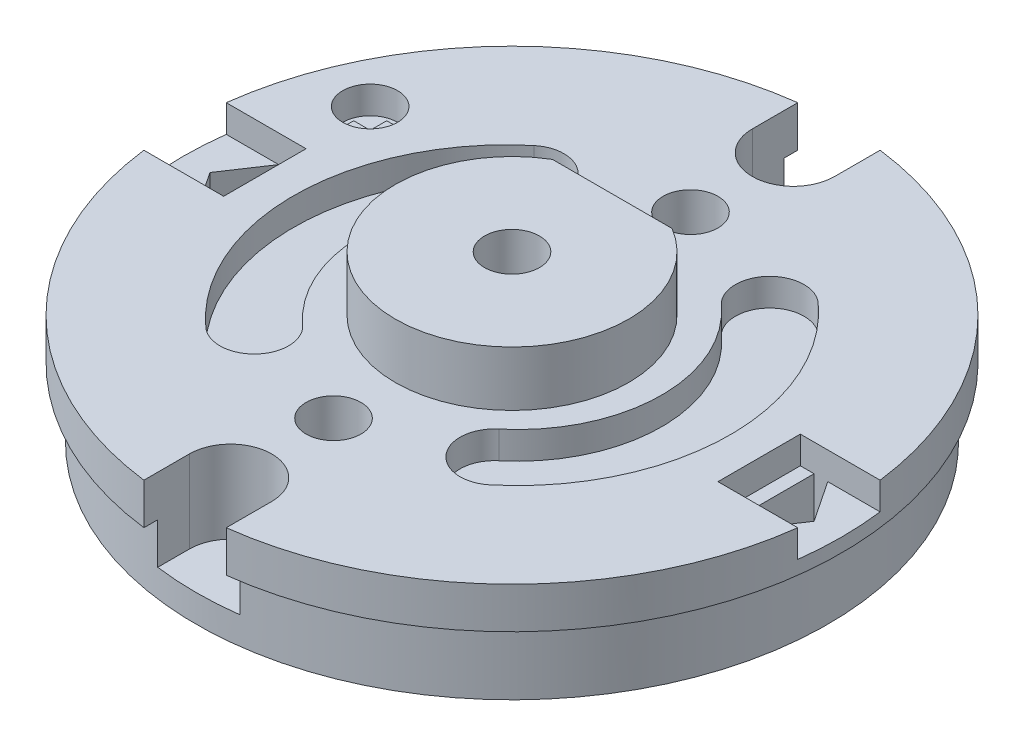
ISO-10303-21;
HEADER;
FILE_DESCRIPTION(('STEP AP214'),'2;1');
FILE_NAME('part.step','',(''),(''),'','','');
FILE_SCHEMA(('AUTOMOTIVE_DESIGN { 1 0 10303 214 1 1 1 1 }'));
ENDSEC;
DATA;
#1=APPLICATION_CONTEXT('core data for automotive mechanical design processes');
#2=APPLICATION_PROTOCOL_DEFINITION('international standard','automotive_design',2000,#1);
#3=PRODUCT_CONTEXT('',#1,'mechanical');
#4=PRODUCT('Part','Part','',(#3));
#5=PRODUCT_RELATED_PRODUCT_CATEGORY('part','',(#4));
#6=PRODUCT_DEFINITION_FORMATION('','',#4);
#7=PRODUCT_DEFINITION_CONTEXT('part definition',#1,'design');
#8=PRODUCT_DEFINITION('design','',#6,#7);
#9=PRODUCT_DEFINITION_SHAPE('','',#8);
#10=(LENGTH_UNIT() NAMED_UNIT(*) SI_UNIT(.MILLI.,.METRE.));
#11=(NAMED_UNIT(*) PLANE_ANGLE_UNIT() SI_UNIT($,.RADIAN.));
#12=(NAMED_UNIT(*) SI_UNIT($,.STERADIAN.) SOLID_ANGLE_UNIT());
#13=UNCERTAINTY_MEASURE_WITH_UNIT(LENGTH_MEASURE(1.E-05),#10,'distance_accuracy_value','');
#14=(GEOMETRIC_REPRESENTATION_CONTEXT(3) GLOBAL_UNCERTAINTY_ASSIGNED_CONTEXT((#13)) GLOBAL_UNIT_ASSIGNED_CONTEXT((#10,
#11,#12)) REPRESENTATION_CONTEXT('',''));
#15=CARTESIAN_POINT('',(0.,0.,0.));
#16=DIRECTION('',(0.,0.,1.));
#17=DIRECTION('',(1.,0.,0.));
#18=AXIS2_PLACEMENT_3D('',#15,#16,#17);
#19=CARTESIAN_POINT('',(-9.16515138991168,3.,-4.));
#20=DIRECTION('',(0.,1.,0.));
#21=DIRECTION('',(0.,0.,1.));
#22=AXIS2_PLACEMENT_3D('',#19,#20,#21);
#23=PLANE('',#22);
#24=CARTESIAN_POINT('',(-9.16515138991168,3.,-4.));
#25=DIRECTION('',(0.,1.,0.));
#26=DIRECTION('',(0.,0.,1.));
#27=AXIS2_PLACEMENT_3D('',#24,#25,#26);
#28=CIRCLE('',#27,1.);
#29=CARTESIAN_POINT('',(-9.16515138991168,3.,-3.));
#30=VERTEX_POINT('',#29);
#31=EDGE_CURVE('E526',#30,#30,#28,.T.);
#32=ORIENTED_EDGE('',*,*,#31,.T.);
#33=EDGE_LOOP('',(#32));
#34=FACE_BOUND('',#33,.T.);
#35=DIRECTION('',(1.,0.,0.));
#36=VECTOR('',#35,1.);
#37=CARTESIAN_POINT('',(-9.31415138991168,3.,-3.85));
#38=LINE('',#37,#36);
#39=CARTESIAN_POINT('',(-9.91515138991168,3.,-3.85));
#40=VERTEX_POINT('',#39);
#41=CARTESIAN_POINT('',(-9.31415138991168,3.,-3.85));
#42=VERTEX_POINT('',#41);
#43=EDGE_CURVE('E1243',#40,#42,#38,.T.);
#44=ORIENTED_EDGE('',*,*,#43,.F.);
#45=DIRECTION('',(0.,0.,1.));
#46=VECTOR('',#45,1.);
#47=CARTESIAN_POINT('',(-9.91515138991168,3.,-3.85));
#48=LINE('',#47,#46);
#49=CARTESIAN_POINT('',(-9.91515138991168,3.,-4.15));
#50=VERTEX_POINT('',#49);
#51=EDGE_CURVE('E386',#50,#40,#48,.T.);
#52=ORIENTED_EDGE('',*,*,#51,.F.);
#53=DIRECTION('',(-1.,0.,0.));
#54=VECTOR('',#53,1.);
#55=CARTESIAN_POINT('',(-9.91515138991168,3.,-4.15));
#56=LINE('',#55,#54);
#57=CARTESIAN_POINT('',(-9.31415138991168,3.,-4.15));
#58=VERTEX_POINT('',#57);
#59=EDGE_CURVE('E382',#58,#50,#56,.T.);
#60=ORIENTED_EDGE('',*,*,#59,.F.);
#61=DIRECTION('',(0.,0.,1.));
#62=VECTOR('',#61,1.);
#63=CARTESIAN_POINT('',(-9.31415138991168,3.,-4.15));
#64=LINE('',#63,#62);
#65=CARTESIAN_POINT('',(-9.31415138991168,3.,-4.751));
#66=VERTEX_POINT('',#65);
#67=EDGE_CURVE('E1239',#66,#58,#64,.T.);
#68=ORIENTED_EDGE('',*,*,#67,.F.);
#69=DIRECTION('',(-1.,0.,0.));
#70=VECTOR('',#69,1.);
#71=CARTESIAN_POINT('',(-9.31415138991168,3.,-4.751));
#72=LINE('',#71,#70);
#73=CARTESIAN_POINT('',(-9.01415138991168,3.,-4.751));
#74=VERTEX_POINT('',#73);
#75=EDGE_CURVE('E1263',#74,#66,#72,.T.);
#76=ORIENTED_EDGE('',*,*,#75,.F.);
#77=DIRECTION('',(0.,0.,-1.));
#78=VECTOR('',#77,1.);
#79=CARTESIAN_POINT('',(-9.01415138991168,3.,-4.751));
#80=LINE('',#79,#78);
#81=CARTESIAN_POINT('',(-9.01415138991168,3.,-4.15));
#82=VERTEX_POINT('',#81);
#83=EDGE_CURVE('E1261',#82,#74,#80,.T.);
#84=ORIENTED_EDGE('',*,*,#83,.F.);
#85=DIRECTION('',(-1.,0.,0.));
#86=VECTOR('',#85,1.);
#87=CARTESIAN_POINT('',(-9.01415138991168,3.,-4.15));
#88=LINE('',#87,#86);
#89=CARTESIAN_POINT('',(-8.41515138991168,3.,-4.15));
#90=VERTEX_POINT('',#89);
#91=EDGE_CURVE('E1259',#90,#82,#88,.T.);
#92=ORIENTED_EDGE('',*,*,#91,.F.);
#93=DIRECTION('',(0.,0.,-1.));
#94=VECTOR('',#93,1.);
#95=CARTESIAN_POINT('',(-8.41515138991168,3.,-4.15));
#96=LINE('',#95,#94);
#97=CARTESIAN_POINT('',(-8.41515138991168,3.,-3.85));
#98=VERTEX_POINT('',#97);
#99=EDGE_CURVE('E1257',#98,#90,#96,.T.);
#100=ORIENTED_EDGE('',*,*,#99,.F.);
#101=DIRECTION('',(1.,0.,0.));
#102=VECTOR('',#101,1.);
#103=CARTESIAN_POINT('',(-8.41515138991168,3.,-3.85));
#104=LINE('',#103,#102);
#105=CARTESIAN_POINT('',(-9.01415138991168,3.,-3.85));
#106=VERTEX_POINT('',#105);
#107=EDGE_CURVE('E1255',#106,#98,#104,.T.);
#108=ORIENTED_EDGE('',*,*,#107,.F.);
#109=DIRECTION('',(0.,0.,-1.));
#110=VECTOR('',#109,1.);
#111=CARTESIAN_POINT('',(-9.01415138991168,3.,-3.85));
#112=LINE('',#111,#110);
#113=CARTESIAN_POINT('',(-9.01415138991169,3.,-3.251));
#114=VERTEX_POINT('',#113);
#115=EDGE_CURVE('E1253',#114,#106,#112,.T.);
#116=ORIENTED_EDGE('',*,*,#115,.F.);
#117=DIRECTION('',(1.,0.,0.));
#118=VECTOR('',#117,1.);
#119=CARTESIAN_POINT('',(-9.01415138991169,3.,-3.251));
#120=LINE('',#119,#118);
#121=CARTESIAN_POINT('',(-9.31415138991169,3.,-3.251));
#122=VERTEX_POINT('',#121);
#123=EDGE_CURVE('E1251',#122,#114,#120,.T.);
#124=ORIENTED_EDGE('',*,*,#123,.F.);
#125=DIRECTION('',(0.,0.,1.));
#126=VECTOR('',#125,1.);
#127=CARTESIAN_POINT('',(-9.31415138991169,3.,-3.251));
#128=LINE('',#127,#126);
#129=EDGE_CURVE('E1245',#42,#122,#128,.T.);
#130=ORIENTED_EDGE('',*,*,#129,.F.);
#131=EDGE_LOOP('',(#44,#52,#60,#68,#76,#84,#92,#100,#108,#116,#124,#130));
#132=FACE_BOUND('',#131,.T.);
#133=ADVANCED_FACE('F34',(#34,#132),#23,.T.);
#134=CARTESIAN_POINT('',(9.99999999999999,0.,-1.50000000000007));
#135=DIRECTION('',(0.83205029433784,0.,-0.554700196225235));
#136=DIRECTION('',(-0.554700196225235,0.,-0.83205029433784));
#137=AXIS2_PLACEMENT_3D('',#134,#135,#136);
#138=PLANE('',#137);
#139=DIRECTION('',(0.554700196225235,0.,0.83205029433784));
#140=VECTOR('',#139,1.);
#141=CARTESIAN_POINT('',(9.99999999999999,3.,-1.50000000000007));
#142=LINE('',#141,#140);
#143=CARTESIAN_POINT('',(9.99999999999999,3.,-1.50000000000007));
#144=VERTEX_POINT('',#143);
#145=CARTESIAN_POINT('',(11.,3.,0.));
#146=VERTEX_POINT('',#145);
#147=EDGE_CURVE('E57',#144,#146,#142,.T.);
#148=ORIENTED_EDGE('',*,*,#147,.F.);
#149=DIRECTION('',(0.,1.,0.));
#150=VECTOR('',#149,1.);
#151=CARTESIAN_POINT('',(9.99999999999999,0.,-1.50000000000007));
#152=LINE('',#151,#150);
#153=CARTESIAN_POINT('',(9.99999999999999,0.,-1.50000000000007));
#154=VERTEX_POINT('',#153);
#155=EDGE_CURVE('E441',#154,#144,#152,.T.);
#156=ORIENTED_EDGE('',*,*,#155,.F.);
#157=DIRECTION('',(-0.554700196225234,0.,-0.83205029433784));
#158=VECTOR('',#157,1.);
#159=CARTESIAN_POINT('',(9.99999999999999,0.,-1.50000000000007));
#160=LINE('',#159,#158);
#161=CARTESIAN_POINT('',(11.,0.,0.));
#162=VERTEX_POINT('',#161);
#163=EDGE_CURVE('E425',#162,#154,#160,.T.);
#164=ORIENTED_EDGE('',*,*,#163,.F.);
#165=DIRECTION('',(0.,1.,0.));
#166=VECTOR('',#165,1.);
#167=CARTESIAN_POINT('',(11.,0.,0.));
#168=LINE('',#167,#166);
#169=EDGE_CURVE('E444',#162,#146,#168,.T.);
#170=ORIENTED_EDGE('',*,*,#169,.T.);
#171=EDGE_LOOP('',(#148,#156,#164,#170));
#172=FACE_BOUND('',#171,.T.);
#173=ADVANCED_FACE('F817',(#172),#138,.F.);
#174=CARTESIAN_POINT('',(11.,0.,0.));
#175=DIRECTION('',(0.832050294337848,0.,0.554700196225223));
#176=DIRECTION('',(0.554700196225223,0.,-0.832050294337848));
#177=AXIS2_PLACEMENT_3D('',#174,#175,#176);
#178=PLANE('',#177);
#179=DIRECTION('',(-0.554700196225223,0.,0.832050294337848));
#180=VECTOR('',#179,1.);
#181=CARTESIAN_POINT('',(11.,3.,0.));
#182=LINE('',#181,#180);
#183=CARTESIAN_POINT('',(10.,3.,1.49999999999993));
#184=VERTEX_POINT('',#183);
#185=EDGE_CURVE('E413',#146,#184,#182,.T.);
#186=ORIENTED_EDGE('',*,*,#185,.F.);
#187=ORIENTED_EDGE('',*,*,#169,.F.);
#188=DIRECTION('',(0.554700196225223,0.,-0.832050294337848));
#189=VECTOR('',#188,1.);
#190=CARTESIAN_POINT('',(11.,0.,0.));
#191=LINE('',#190,#189);
#192=CARTESIAN_POINT('',(10.,0.,1.49999999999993));
#193=VERTEX_POINT('',#192);
#194=EDGE_CURVE('E438',#193,#162,#191,.T.);
#195=ORIENTED_EDGE('',*,*,#194,.F.);
#196=DIRECTION('',(0.,1.,0.));
#197=VECTOR('',#196,1.);
#198=CARTESIAN_POINT('',(10.,0.,1.49999999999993));
#199=LINE('',#198,#197);
#200=EDGE_CURVE('E448',#193,#184,#199,.T.);
#201=ORIENTED_EDGE('',*,*,#200,.T.);
#202=EDGE_LOOP('',(#186,#187,#195,#201));
#203=FACE_BOUND('',#202,.T.);
#204=ADVANCED_FACE('F791',(#203),#178,.F.);
#205=CARTESIAN_POINT('',(9.50000000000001,0.,1.49999999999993));
#206=DIRECTION('',(-1.,0.,0.));
#207=DIRECTION('',(0.,0.,1.));
#208=AXIS2_PLACEMENT_3D('',#205,#206,#207);
#209=PLANE('',#208);
#210=DIRECTION('',(0.,0.,-1.));
#211=VECTOR('',#210,1.);
#212=CARTESIAN_POINT('',(9.50000000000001,3.,1.49999999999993));
#213=LINE('',#212,#211);
#214=CARTESIAN_POINT('',(9.50000000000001,3.,1.49999999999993));
#215=VERTEX_POINT('',#214);
#216=CARTESIAN_POINT('',(9.49999999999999,3.,-1.50000000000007));
#217=VERTEX_POINT('',#216);
#218=EDGE_CURVE('E409',#215,#217,#213,.T.);
#219=ORIENTED_EDGE('',*,*,#218,.F.);
#220=DIRECTION('',(0.,1.,0.));
#221=VECTOR('',#220,1.);
#222=CARTESIAN_POINT('',(9.50000000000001,0.,1.49999999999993));
#223=LINE('',#222,#221);
#224=CARTESIAN_POINT('',(9.50000000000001,0.,1.49999999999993));
#225=VERTEX_POINT('',#224);
#226=EDGE_CURVE('E451',#225,#215,#223,.T.);
#227=ORIENTED_EDGE('',*,*,#226,.F.);
#228=DIRECTION('',(0.,0.,1.));
#229=VECTOR('',#228,1.);
#230=CARTESIAN_POINT('',(9.50000000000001,0.,1.49999999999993));
#231=LINE('',#230,#229);
#232=CARTESIAN_POINT('',(9.49999999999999,0.,-1.50000000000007));
#233=VERTEX_POINT('',#232);
#234=EDGE_CURVE('E432',#233,#225,#231,.T.);
#235=ORIENTED_EDGE('',*,*,#234,.F.);
#236=DIRECTION('',(0.,1.,0.));
#237=VECTOR('',#236,1.);
#238=CARTESIAN_POINT('',(9.49999999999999,0.,-1.50000000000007));
#239=LINE('',#238,#237);
#240=EDGE_CURVE('E454',#233,#217,#239,.T.);
#241=ORIENTED_EDGE('',*,*,#240,.T.);
#242=EDGE_LOOP('',(#219,#227,#235,#241));
#243=FACE_BOUND('',#242,.T.);
#244=ADVANCED_FACE('F799',(#243),#209,.F.);
#245=CARTESIAN_POINT('',(0.,0.,0.));
#246=DIRECTION('',(0.,-1.,0.));
#247=DIRECTION('',(0.,0.,-1.));
#248=AXIS2_PLACEMENT_3D('',#245,#246,#247);
#249=CYLINDRICAL_SURFACE('',#248,12.);
#250=CARTESIAN_POINT('',(0.,3.,0.));
#251=DIRECTION('',(0.,1.,0.));
#252=DIRECTION('',(0.,0.,1.));
#253=AXIS2_PLACEMENT_3D('',#250,#251,#252);
#254=CIRCLE('',#253,12.);
#255=CARTESIAN_POINT('',(11.9058808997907,3.,1.49999999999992));
#256=VERTEX_POINT('',#255);
#257=CARTESIAN_POINT('',(11.9058808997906,3.,-1.50000000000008));
#258=VERTEX_POINT('',#257);
#259=EDGE_CURVE('E416',#256,#258,#254,.T.);
#260=ORIENTED_EDGE('',*,*,#259,.F.);
#261=DIRECTION('',(0.,-1.,0.));
#262=VECTOR('',#261,1.);
#263=CARTESIAN_POINT('',(11.9058808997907,0.,1.49999999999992));
#264=LINE('',#263,#262);
#265=CARTESIAN_POINT('',(11.9058808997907,4.,1.49999999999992));
#266=VERTEX_POINT('',#265);
#267=EDGE_CURVE('E421',#256,#266,#264,.F.);
#268=ORIENTED_EDGE('',*,*,#267,.T.);
#269=CARTESIAN_POINT('',(0.,4.,0.));
#270=DIRECTION('',(0.,-1.,0.));
#271=DIRECTION('',(0.,0.,-1.));
#272=AXIS2_PLACEMENT_3D('',#269,#270,#271);
#273=CIRCLE('',#272,12.);
#274=CARTESIAN_POINT('',(1.50000000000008,4.,11.9058808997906));
#275=VERTEX_POINT('',#274);
#276=EDGE_CURVE('E691',#266,#275,#273,.T.);
#277=ORIENTED_EDGE('',*,*,#276,.T.);
#278=DIRECTION('',(0.,-1.,0.));
#279=VECTOR('',#278,1.);
#280=CARTESIAN_POINT('',(1.50000000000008,0.,11.9058808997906));
#281=LINE('',#280,#279);
#282=CARTESIAN_POINT('',(1.50000000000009,2.5,11.9058808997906));
#283=VERTEX_POINT('',#282);
#284=EDGE_CURVE('E486',#275,#283,#281,.T.);
#285=ORIENTED_EDGE('',*,*,#284,.T.);
#286=CARTESIAN_POINT('',(0.,2.5,0.));
#287=DIRECTION('',(0.,-1.,0.));
#288=DIRECTION('',(0.,0.,-1.));
#289=AXIS2_PLACEMENT_3D('',#286,#287,#288);
#290=CIRCLE('',#289,12.);
#291=CARTESIAN_POINT('',(1.5,2.5,-11.9058808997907));
#292=VERTEX_POINT('',#291);
#293=EDGE_CURVE('E683',#292,#283,#290,.T.);
#294=ORIENTED_EDGE('',*,*,#293,.F.);
#295=DIRECTION('',(0.,-1.,0.));
#296=VECTOR('',#295,1.);
#297=CARTESIAN_POINT('',(1.5,0.,-11.9058808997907));
#298=LINE('',#297,#296);
#299=CARTESIAN_POINT('',(1.5,4.,-11.9058808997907));
#300=VERTEX_POINT('',#299);
#301=EDGE_CURVE('E619',#292,#300,#298,.F.);
#302=ORIENTED_EDGE('',*,*,#301,.T.);
#303=CARTESIAN_POINT('',(11.9058808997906,4.,-1.50000000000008));
#304=VERTEX_POINT('',#303);
#305=EDGE_CURVE('E687',#300,#304,#273,.T.);
#306=ORIENTED_EDGE('',*,*,#305,.T.);
#307=DIRECTION('',(0.,-1.,0.));
#308=VECTOR('',#307,1.);
#309=CARTESIAN_POINT('',(11.9058808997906,0.,-1.50000000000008));
#310=LINE('',#309,#308);
#311=EDGE_CURVE('E418',#304,#258,#310,.T.);
#312=ORIENTED_EDGE('',*,*,#311,.T.);
#313=EDGE_LOOP('',(#260,#268,#277,#285,#294,#302,#306,#312));
#314=FACE_BOUND('',#313,.T.);
#315=ADVANCED_FACE('F754',(#314),#249,.T.);
#316=CARTESIAN_POINT('',(-12.,2.5,0.));
#317=DIRECTION('',(0.,1.,0.));
#318=DIRECTION('',(0.,0.,1.));
#319=AXIS2_PLACEMENT_3D('',#316,#317,#318);
#320=PLANE('',#319);
#321=ORIENTED_EDGE('',*,*,#293,.T.);
#322=DIRECTION('',(0.,0.,-1.));
#323=VECTOR('',#322,1.);
#324=CARTESIAN_POINT('',(1.5,2.5,0.));
#325=LINE('',#324,#323);
#326=CARTESIAN_POINT('',(1.50000000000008,2.5,11.4017542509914));
#327=VERTEX_POINT('',#326);
#328=EDGE_CURVE('E483',#283,#327,#325,.T.);
#329=ORIENTED_EDGE('',*,*,#328,.T.);
#330=CARTESIAN_POINT('',(0.,2.5,0.));
#331=DIRECTION('',(0.,-1.,0.));
#332=DIRECTION('',(0.,0.,-1.));
#333=AXIS2_PLACEMENT_3D('',#330,#331,#332);
#334=CIRCLE('',#333,11.5);
#335=CARTESIAN_POINT('',(1.5,2.5,-11.4017542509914));
#336=VERTEX_POINT('',#335);
#337=EDGE_CURVE('E679',#336,#327,#334,.T.);
#338=ORIENTED_EDGE('',*,*,#337,.F.);
#339=DIRECTION('',(0.,0.,-1.));
#340=VECTOR('',#339,1.);
#341=CARTESIAN_POINT('',(1.5,2.5,0.));
#342=LINE('',#341,#340);
#343=EDGE_CURVE('E615',#336,#292,#342,.T.);
#344=ORIENTED_EDGE('',*,*,#343,.T.);
#345=EDGE_LOOP('',(#321,#329,#338,#344));
#346=FACE_BOUND('',#345,.T.);
#347=ADVANCED_FACE('F772',(#346),#320,.F.);
#348=CARTESIAN_POINT('',(-8.5,2.5,0.));
#349=DIRECTION('',(0.,1.,0.));
#350=DIRECTION('',(0.,0.,1.));
#351=AXIS2_PLACEMENT_3D('',#348,#349,#350);
#352=PLANE('',#351);
#353=CARTESIAN_POINT('',(0.,2.5,-6.5));
#354=DIRECTION('',(0.,1.,0.));
#355=DIRECTION('',(0.,0.,1.));
#356=AXIS2_PLACEMENT_3D('',#353,#354,#355);
#357=CIRCLE('',#356,1.);
#358=CARTESIAN_POINT('',(0.,2.5,-5.5));
#359=VERTEX_POINT('',#358);
#360=EDGE_CURVE('E666',#359,#359,#357,.F.);
#361=ORIENTED_EDGE('',*,*,#360,.F.);
#362=EDGE_LOOP('',(#361));
#363=FACE_BOUND('',#362,.T.);
#364=CARTESIAN_POINT('',(0.,2.5,0.));
#365=DIRECTION('',(0.,-1.,0.));
#366=DIRECTION('',(0.,0.,-1.));
#367=AXIS2_PLACEMENT_3D('',#364,#365,#366);
#368=CIRCLE('',#367,1.);
#369=CARTESIAN_POINT('',(0.,2.5,-1.));
#370=VERTEX_POINT('',#369);
#371=EDGE_CURVE('E700',#370,#370,#368,.T.);
#372=ORIENTED_EDGE('',*,*,#371,.F.);
#373=EDGE_LOOP('',(#372));
#374=FACE_BOUND('',#373,.T.);
#375=CARTESIAN_POINT('',(0.,2.5,0.));
#376=DIRECTION('',(0.,-1.,0.));
#377=DIRECTION('',(0.,0.,-1.));
#378=AXIS2_PLACEMENT_3D('',#375,#376,#377);
#379=CIRCLE('',#378,8.5);
#380=CARTESIAN_POINT('',(0.,2.5,-8.5));
#381=VERTEX_POINT('',#380);
#382=EDGE_CURVE('E669',#381,#381,#379,.T.);
#383=ORIENTED_EDGE('',*,*,#382,.T.);
#384=EDGE_LOOP('',(#383));
#385=FACE_BOUND('',#384,.T.);
#386=CARTESIAN_POINT('',(0.,2.5,6.5));
#387=DIRECTION('',(0.,1.,0.));
#388=DIRECTION('',(0.,0.,1.));
#389=AXIS2_PLACEMENT_3D('',#386,#387,#388);
#390=CIRCLE('',#389,1.);
#391=CARTESIAN_POINT('',(0.,2.5,7.5));
#392=VERTEX_POINT('',#391);
#393=EDGE_CURVE('E522',#392,#392,#390,.F.);
#394=ORIENTED_EDGE('',*,*,#393,.F.);
#395=EDGE_LOOP('',(#394));
#396=FACE_BOUND('',#395,.T.);
#397=ADVANCED_FACE('F36',(#363,#374,#385,#396),#352,.F.);
#398=CARTESIAN_POINT('',(-4.25,4.,0.));
#399=DIRECTION('',(0.,-1.,0.));
#400=DIRECTION('',(0.,0.,-1.));
#401=AXIS2_PLACEMENT_3D('',#398,#399,#400);
#402=PLANE('',#401);
#403=ORIENTED_EDGE('',*,*,#276,.F.);
#404=DIRECTION('',(1.,0.,0.));
#405=VECTOR('',#404,1.);
#406=CARTESIAN_POINT('',(10.,4.,1.49999999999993));
#407=LINE('',#406,#405);
#408=CARTESIAN_POINT('',(9.00000000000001,4.,1.49999999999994));
#409=VERTEX_POINT('',#408);
#410=EDGE_CURVE('E429',#409,#266,#407,.T.);
#411=ORIENTED_EDGE('',*,*,#410,.F.);
#412=DIRECTION('',(0.,0.,1.));
#413=VECTOR('',#412,1.);
#414=CARTESIAN_POINT('',(9.00000000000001,4.,1.49999999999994));
#415=LINE('',#414,#413);
#416=CARTESIAN_POINT('',(8.99999999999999,4.,-1.50000000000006));
#417=VERTEX_POINT('',#416);
#418=EDGE_CURVE('E388',#417,#409,#415,.T.);
#419=ORIENTED_EDGE('',*,*,#418,.F.);
#420=DIRECTION('',(-1.,0.,0.));
#421=VECTOR('',#420,1.);
#422=CARTESIAN_POINT('',(9.49999999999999,4.,-1.50000000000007));
#423=LINE('',#422,#421);
#424=EDGE_CURVE('E424',#304,#417,#423,.T.);
#425=ORIENTED_EDGE('',*,*,#424,.F.);
#426=ORIENTED_EDGE('',*,*,#305,.F.);
#427=DIRECTION('',(0.,0.,-1.));
#428=VECTOR('',#427,1.);
#429=CARTESIAN_POINT('',(1.5,4.,-15.));
#430=LINE('',#429,#428);
#431=CARTESIAN_POINT('',(1.5,4.,-10.25));
#432=VERTEX_POINT('',#431);
#433=EDGE_CURVE('E609',#432,#300,#430,.T.);
#434=ORIENTED_EDGE('',*,*,#433,.F.);
#435=CARTESIAN_POINT('',(0.,4.,-10.25));
#436=DIRECTION('',(0.,1.,0.));
#437=DIRECTION('',(0.,0.,-1.));
#438=AXIS2_PLACEMENT_3D('',#435,#436,#437);
#439=CIRCLE('',#438,1.5);
#440=CARTESIAN_POINT('',(-1.5,4.,-10.25));
#441=VERTEX_POINT('',#440);
#442=EDGE_CURVE('E586',#441,#432,#439,.T.);
#443=ORIENTED_EDGE('',*,*,#442,.F.);
#444=DIRECTION('',(0.,0.,1.));
#445=VECTOR('',#444,1.);
#446=CARTESIAN_POINT('',(-1.5,4.,-10.25));
#447=LINE('',#446,#445);
#448=CARTESIAN_POINT('',(-1.5,4.,-11.9058808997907));
#449=VERTEX_POINT('',#448);
#450=EDGE_CURVE('E602',#449,#441,#447,.T.);
#451=ORIENTED_EDGE('',*,*,#450,.F.);
#452=CARTESIAN_POINT('',(-11.9058808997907,4.,-1.5));
#453=VERTEX_POINT('',#452);
#454=EDGE_CURVE('E686',#453,#449,#273,.T.);
#455=ORIENTED_EDGE('',*,*,#454,.F.);
#456=DIRECTION('',(-1.,0.,0.));
#457=VECTOR('',#456,1.);
#458=CARTESIAN_POINT('',(-10.,4.,-1.5));
#459=LINE('',#458,#457);
#460=CARTESIAN_POINT('',(-9.,4.,-1.5));
#461=VERTEX_POINT('',#460);
#462=EDGE_CURVE('E568',#461,#453,#459,.T.);
#463=ORIENTED_EDGE('',*,*,#462,.F.);
#464=DIRECTION('',(0.,0.,-1.));
#465=VECTOR('',#464,1.);
#466=CARTESIAN_POINT('',(-9.,4.,-1.5));
#467=LINE('',#466,#465);
#468=CARTESIAN_POINT('',(-9.,4.,1.5));
#469=VERTEX_POINT('',#468);
#470=EDGE_CURVE('E529',#469,#461,#467,.T.);
#471=ORIENTED_EDGE('',*,*,#470,.F.);
#472=DIRECTION('',(1.,0.,0.));
#473=VECTOR('',#472,1.);
#474=CARTESIAN_POINT('',(-9.5,4.,1.5));
#475=LINE('',#474,#473);
#476=CARTESIAN_POINT('',(-11.9058808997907,4.,1.5));
#477=VERTEX_POINT('',#476);
#478=EDGE_CURVE('E563',#477,#469,#475,.T.);
#479=ORIENTED_EDGE('',*,*,#478,.F.);
#480=CARTESIAN_POINT('',(-1.49999999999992,4.,11.9058808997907));
#481=VERTEX_POINT('',#480);
#482=EDGE_CURVE('E747',#481,#477,#273,.T.);
#483=ORIENTED_EDGE('',*,*,#482,.F.);
#484=DIRECTION('',(0.,0.,1.));
#485=VECTOR('',#484,1.);
#486=CARTESIAN_POINT('',(-1.49999999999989,4.,15.));
#487=LINE('',#486,#485);
#488=CARTESIAN_POINT('',(-1.49999999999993,4.,10.25));
#489=VERTEX_POINT('',#488);
#490=EDGE_CURVE('E470',#489,#481,#487,.T.);
#491=ORIENTED_EDGE('',*,*,#490,.F.);
#492=CARTESIAN_POINT('',(0.,4.,10.25));
#493=DIRECTION('',(0.,1.,0.));
#494=DIRECTION('',(0.,0.,1.));
#495=AXIS2_PLACEMENT_3D('',#492,#493,#494);
#496=CIRCLE('',#495,1.5);
#497=CARTESIAN_POINT('',(1.50000000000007,4.,10.25));
#498=VERTEX_POINT('',#497);
#499=EDGE_CURVE('E447',#498,#489,#496,.T.);
#500=ORIENTED_EDGE('',*,*,#499,.F.);
#501=DIRECTION('',(0.,0.,-1.));
#502=VECTOR('',#501,1.);
#503=CARTESIAN_POINT('',(1.50000000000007,4.,10.25));
#504=LINE('',#503,#502);
#505=EDGE_CURVE('E463',#275,#498,#504,.T.);
#506=ORIENTED_EDGE('',*,*,#505,.F.);
#507=EDGE_LOOP('',(#403,#411,#419,#425,#426,#434,#443,#451,#455,#463,#471,#479,#483,#491,#500,#506));
#508=FACE_BOUND('',#507,.T.);
#509=CARTESIAN_POINT('',(-0.00282444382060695,4.,-0.208431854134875));
#510=DIRECTION('',(0.,1.,0.));
#511=DIRECTION('',(0.,0.,-1.));
#512=AXIS2_PLACEMENT_3D('',#509,#510,#511);
#513=CIRCLE('',#512,7.75);
#514=CARTESIAN_POINT('',(4.94917231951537,4.,5.75313069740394));
#515=VERTEX_POINT('',#514);
#516=CARTESIAN_POINT('',(5.18767943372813,4.,-5.96353128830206));
#517=VERTEX_POINT('',#516);
#518=EDGE_CURVE('E505',#515,#517,#513,.T.);
#519=ORIENTED_EDGE('',*,*,#518,.F.);
#520=CARTESIAN_POINT('',(4.1504631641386,4.,4.79158835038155));
#521=DIRECTION('',(0.,1.,0.));
#522=DIRECTION('',(0.,0.,1.));
#523=AXIS2_PLACEMENT_3D('',#520,#521,#522);
#524=CIRCLE('',#523,1.25);
#525=CARTESIAN_POINT('',(3.35175400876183,4.,3.83004600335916));
#526=VERTEX_POINT('',#525);
#527=EDGE_CURVE('E489',#526,#515,#524,.T.);
#528=ORIENTED_EDGE('',*,*,#527,.F.);
#529=CARTESIAN_POINT('',(-0.00282444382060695,4.,-0.208431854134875));
#530=DIRECTION('',(0.,-1.,0.));
#531=DIRECTION('',(0.,0.,-1.));
#532=AXIS2_PLACEMENT_3D('',#529,#530,#531);
#533=CIRCLE('',#532,5.25);
#534=CARTESIAN_POINT('',(3.51332334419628,4.,-4.10704759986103));
#535=VERTEX_POINT('',#534);
#536=EDGE_CURVE('E494',#535,#526,#533,.T.);
#537=ORIENTED_EDGE('',*,*,#536,.F.);
#538=CARTESIAN_POINT('',(4.35050138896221,4.,-5.03528944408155));
#539=DIRECTION('',(0.,1.,0.));
#540=DIRECTION('',(0.,0.,1.));
#541=AXIS2_PLACEMENT_3D('',#538,#539,#540);
#542=CIRCLE('',#541,1.25);
#543=EDGE_CURVE('E508',#517,#535,#542,.T.);
#544=ORIENTED_EDGE('',*,*,#543,.F.);
#545=EDGE_LOOP('',(#519,#528,#537,#544));
#546=FACE_BOUND('',#545,.T.);
#547=CARTESIAN_POINT('',(0.,4.,-6.5));
#548=DIRECTION('',(0.,-1.,0.));
#549=DIRECTION('',(0.,0.,-1.));
#550=AXIS2_PLACEMENT_3D('',#547,#548,#549);
#551=CIRCLE('',#550,1.);
#552=CARTESIAN_POINT('',(0.,4.,-7.5));
#553=VERTEX_POINT('',#552);
#554=EDGE_CURVE('E665',#553,#553,#551,.F.);
#555=ORIENTED_EDGE('',*,*,#554,.F.);
#556=EDGE_LOOP('',(#555));
#557=FACE_BOUND('',#556,.T.);
#558=DIRECTION('',(1.,0.,0.));
#559=VECTOR('',#558,1.);
#560=CARTESIAN_POINT('',(-12.,4.,-3.65));
#561=LINE('',#560,#559);
#562=CARTESIAN_POINT('',(-2.17715410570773,4.,-3.65));
#563=VERTEX_POINT('',#562);
#564=CARTESIAN_POINT('',(2.17715410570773,4.,-3.65));
#565=VERTEX_POINT('',#564);
#566=EDGE_CURVE('E654',#563,#565,#561,.T.);
#567=ORIENTED_EDGE('',*,*,#566,.T.);
#568=CARTESIAN_POINT('',(0.,4.,0.));
#569=DIRECTION('',(0.,-1.,0.));
#570=DIRECTION('',(0.,0.,-1.));
#571=AXIS2_PLACEMENT_3D('',#568,#569,#570);
#572=CIRCLE('',#571,4.25);
#573=EDGE_CURVE('E690',#565,#563,#572,.T.);
#574=ORIENTED_EDGE('',*,*,#573,.T.);
#575=EDGE_LOOP('',(#567,#574));
#576=FACE_BOUND('',#575,.T.);
#577=CARTESIAN_POINT('',(0.0028244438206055,4.,0.208431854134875));
#578=DIRECTION('',(0.,1.,0.));
#579=DIRECTION('',(0.,0.,1.));
#580=AXIS2_PLACEMENT_3D('',#577,#578,#579);
#581=CIRCLE('',#580,7.75);
#582=CARTESIAN_POINT('',(-4.94917231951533,4.,-5.75313069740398));
#583=VERTEX_POINT('',#582);
#584=CARTESIAN_POINT('',(-5.18767943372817,4.,5.96353128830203));
#585=VERTEX_POINT('',#584);
#586=EDGE_CURVE('E644',#583,#585,#581,.T.);
#587=ORIENTED_EDGE('',*,*,#586,.F.);
#588=CARTESIAN_POINT('',(-4.15046316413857,4.,-4.79158835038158));
#589=DIRECTION('',(0.,1.,0.));
#590=DIRECTION('',(0.,0.,-1.));
#591=AXIS2_PLACEMENT_3D('',#588,#589,#590);
#592=CIRCLE('',#591,1.25);
#593=CARTESIAN_POINT('',(-3.3517540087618,4.,-3.83004600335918));
#594=VERTEX_POINT('',#593);
#595=EDGE_CURVE('E628',#594,#583,#592,.T.);
#596=ORIENTED_EDGE('',*,*,#595,.F.);
#597=CARTESIAN_POINT('',(0.0028244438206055,4.,0.208431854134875));
#598=DIRECTION('',(0.,-1.,0.));
#599=DIRECTION('',(0.,0.,1.));
#600=AXIS2_PLACEMENT_3D('',#597,#598,#599);
#601=CIRCLE('',#600,5.25);
#602=CARTESIAN_POINT('',(-3.51332334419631,4.,4.10704759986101));
#603=VERTEX_POINT('',#602);
#604=EDGE_CURVE('E633',#603,#594,#601,.T.);
#605=ORIENTED_EDGE('',*,*,#604,.F.);
#606=CARTESIAN_POINT('',(-4.35050138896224,4.,5.03528944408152));
#607=DIRECTION('',(0.,1.,0.));
#608=DIRECTION('',(0.,0.,-1.));
#609=AXIS2_PLACEMENT_3D('',#606,#607,#608);
#610=CIRCLE('',#609,1.25);
#611=EDGE_CURVE('E647',#585,#603,#610,.T.);
#612=ORIENTED_EDGE('',*,*,#611,.F.);
#613=EDGE_LOOP('',(#587,#596,#605,#612));
#614=FACE_BOUND('',#613,.T.);
#615=CARTESIAN_POINT('',(-9.16515138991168,4.,-4.));
#616=DIRECTION('',(0.,1.,0.));
#617=DIRECTION('',(0.,0.,1.));
#618=AXIS2_PLACEMENT_3D('',#615,#616,#617);
#619=CIRCLE('',#618,1.);
#620=CARTESIAN_POINT('',(-9.16515138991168,4.,-3.));
#621=VERTEX_POINT('',#620);
#622=EDGE_CURVE('E525',#621,#621,#619,.T.);
#623=ORIENTED_EDGE('',*,*,#622,.F.);
#624=EDGE_LOOP('',(#623));
#625=FACE_BOUND('',#624,.T.);
#626=CARTESIAN_POINT('',(0.,4.,6.5));
#627=DIRECTION('',(0.,-1.,0.));
#628=DIRECTION('',(0.,0.,-1.));
#629=AXIS2_PLACEMENT_3D('',#626,#627,#628);
#630=CIRCLE('',#629,1.);
#631=CARTESIAN_POINT('',(0.,4.,5.5));
#632=VERTEX_POINT('',#631);
#633=EDGE_CURVE('E515',#632,#632,#630,.F.);
#634=ORIENTED_EDGE('',*,*,#633,.F.);
#635=EDGE_LOOP('',(#634));
#636=FACE_BOUND('',#635,.T.);
#637=ADVANCED_FACE('F761',(#508,#546,#557,#576,#614,#625,#636),#402,.F.);
#638=CARTESIAN_POINT('',(-10.,0.,1.5));
#639=DIRECTION('',(-0.832050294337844,0.,0.554700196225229));
#640=DIRECTION('',(0.554700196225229,0.,0.832050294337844));
#641=AXIS2_PLACEMENT_3D('',#638,#639,#640);
#642=PLANE('',#641);
#643=DIRECTION('',(-0.554700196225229,0.,-0.832050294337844));
#644=VECTOR('',#643,1.);
#645=CARTESIAN_POINT('',(-10.,3.,1.5));
#646=LINE('',#645,#644);
#647=CARTESIAN_POINT('',(-10.,3.,1.5));
#648=VERTEX_POINT('',#647);
#649=CARTESIAN_POINT('',(-11.,3.,0.));
#650=VERTEX_POINT('',#649);
#651=EDGE_CURVE('E553',#648,#650,#646,.T.);
#652=ORIENTED_EDGE('',*,*,#651,.F.);
#653=DIRECTION('',(0.,1.,0.));
#654=VECTOR('',#653,1.);
#655=CARTESIAN_POINT('',(-10.,0.,1.5));
#656=LINE('',#655,#654);
#657=CARTESIAN_POINT('',(-10.,0.,1.5));
#658=VERTEX_POINT('',#657);
#659=EDGE_CURVE('E580',#658,#648,#656,.T.);
#660=ORIENTED_EDGE('',*,*,#659,.F.);
#661=DIRECTION('',(0.554700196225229,0.,0.832050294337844));
#662=VECTOR('',#661,1.);
#663=CARTESIAN_POINT('',(-10.,0.,1.5));
#664=LINE('',#663,#662);
#665=CARTESIAN_POINT('',(-11.,0.,0.));
#666=VERTEX_POINT('',#665);
#667=EDGE_CURVE('E564',#666,#658,#664,.T.);
#668=ORIENTED_EDGE('',*,*,#667,.F.);
#669=DIRECTION('',(0.,1.,0.));
#670=VECTOR('',#669,1.);
#671=CARTESIAN_POINT('',(-11.,0.,0.));
#672=LINE('',#671,#670);
#673=EDGE_CURVE('E583',#666,#650,#672,.T.);
#674=ORIENTED_EDGE('',*,*,#673,.T.);
#675=EDGE_LOOP('',(#652,#660,#668,#674));
#676=FACE_BOUND('',#675,.T.);
#677=ADVANCED_FACE('F847',(#676),#642,.F.);
#678=CARTESIAN_POINT('',(-11.,0.,0.));
#679=DIRECTION('',(-0.832050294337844,0.,-0.554700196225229));
#680=DIRECTION('',(-0.554700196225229,0.,0.832050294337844));
#681=AXIS2_PLACEMENT_3D('',#678,#679,#680);
#682=PLANE('',#681);
#683=DIRECTION('',(0.554700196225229,0.,-0.832050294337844));
#684=VECTOR('',#683,1.);
#685=CARTESIAN_POINT('',(-11.,3.,0.));
#686=LINE('',#685,#684);
#687=CARTESIAN_POINT('',(-10.,3.,-1.5));
#688=VERTEX_POINT('',#687);
#689=EDGE_CURVE('E551',#650,#688,#686,.T.);
#690=ORIENTED_EDGE('',*,*,#689,.F.);
#691=ORIENTED_EDGE('',*,*,#673,.F.);
#692=DIRECTION('',(-0.554700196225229,0.,0.832050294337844));
#693=VECTOR('',#692,1.);
#694=CARTESIAN_POINT('',(-11.,0.,0.));
#695=LINE('',#694,#693);
#696=CARTESIAN_POINT('',(-10.,0.,-1.5));
#697=VERTEX_POINT('',#696);
#698=EDGE_CURVE('E577',#697,#666,#695,.T.);
#699=ORIENTED_EDGE('',*,*,#698,.F.);
#700=DIRECTION('',(0.,1.,0.));
#701=VECTOR('',#700,1.);
#702=CARTESIAN_POINT('',(-10.,0.,-1.5));
#703=LINE('',#702,#701);
#704=EDGE_CURVE('E587',#697,#688,#703,.T.);
#705=ORIENTED_EDGE('',*,*,#704,.T.);
#706=EDGE_LOOP('',(#690,#691,#699,#705));
#707=FACE_BOUND('',#706,.T.);
#708=ADVANCED_FACE('F843',(#707),#682,.F.);
#709=CARTESIAN_POINT('',(-9.5,0.,-1.5));
#710=DIRECTION('',(1.,0.,0.));
#711=DIRECTION('',(0.,0.,-1.));
#712=AXIS2_PLACEMENT_3D('',#709,#710,#711);
#713=PLANE('',#712);
#714=DIRECTION('',(0.,0.,1.));
#715=VECTOR('',#714,1.);
#716=CARTESIAN_POINT('',(-9.5,3.,-1.5));
#717=LINE('',#716,#715);
#718=CARTESIAN_POINT('',(-9.5,3.,-1.5));
#719=VERTEX_POINT('',#718);
#720=CARTESIAN_POINT('',(-9.5,3.,1.5));
#721=VERTEX_POINT('',#720);
#722=EDGE_CURVE('E547',#719,#721,#717,.T.);
#723=ORIENTED_EDGE('',*,*,#722,.F.);
#724=DIRECTION('',(0.,1.,0.));
#725=VECTOR('',#724,1.);
#726=CARTESIAN_POINT('',(-9.5,0.,-1.5));
#727=LINE('',#726,#725);
#728=CARTESIAN_POINT('',(-9.5,0.,-1.5));
#729=VERTEX_POINT('',#728);
#730=EDGE_CURVE('E590',#729,#719,#727,.T.);
#731=ORIENTED_EDGE('',*,*,#730,.F.);
#732=DIRECTION('',(0.,0.,-1.));
#733=VECTOR('',#732,1.);
#734=CARTESIAN_POINT('',(-9.5,0.,-1.5));
#735=LINE('',#734,#733);
#736=CARTESIAN_POINT('',(-9.5,0.,1.5));
#737=VERTEX_POINT('',#736);
#738=EDGE_CURVE('E571',#737,#729,#735,.T.);
#739=ORIENTED_EDGE('',*,*,#738,.F.);
#740=DIRECTION('',(0.,1.,0.));
#741=VECTOR('',#740,1.);
#742=CARTESIAN_POINT('',(-9.5,0.,1.5));
#743=LINE('',#742,#741);
#744=EDGE_CURVE('E593',#737,#721,#743,.T.);
#745=ORIENTED_EDGE('',*,*,#744,.T.);
#746=EDGE_LOOP('',(#723,#731,#739,#745));
#747=FACE_BOUND('',#746,.T.);
#748=ADVANCED_FACE('F846',(#747),#713,.F.);
#749=CARTESIAN_POINT('',(0.,0.,0.));
#750=DIRECTION('',(0.,-1.,0.));
#751=DIRECTION('',(0.,0.,-1.));
#752=AXIS2_PLACEMENT_3D('',#749,#750,#751);
#753=CYLINDRICAL_SURFACE('',#752,1.);
#754=CARTESIAN_POINT('',(0.,6.,0.));
#755=DIRECTION('',(0.,-1.,0.));
#756=DIRECTION('',(0.,0.,-1.));
#757=AXIS2_PLACEMENT_3D('',#754,#755,#756);
#758=CIRCLE('',#757,1.);
#759=CARTESIAN_POINT('',(0.,6.,-1.));
#760=VERTEX_POINT('',#759);
#761=EDGE_CURVE('E697',#760,#760,#758,.T.);
#762=ORIENTED_EDGE('',*,*,#761,.F.);
#763=EDGE_LOOP('',(#762));
#764=FACE_BOUND('',#763,.T.);
#765=ORIENTED_EDGE('',*,*,#371,.T.);
#766=EDGE_LOOP('',(#765));
#767=FACE_BOUND('',#766,.T.);
#768=ADVANCED_FACE('F857',(#764,#767),#753,.F.);
#769=CARTESIAN_POINT('',(-1.,6.,0.));
#770=DIRECTION('',(0.,-1.,0.));
#771=DIRECTION('',(0.,0.,-1.));
#772=AXIS2_PLACEMENT_3D('',#769,#770,#771);
#773=PLANE('',#772);
#774=CARTESIAN_POINT('',(0.,6.,0.));
#775=DIRECTION('',(0.,-1.,0.));
#776=DIRECTION('',(0.,0.,-1.));
#777=AXIS2_PLACEMENT_3D('',#774,#775,#776);
#778=CIRCLE('',#777,4.25);
#779=CARTESIAN_POINT('',(2.17715410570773,6.,-3.65));
#780=VERTEX_POINT('',#779);
#781=CARTESIAN_POINT('',(-2.17715410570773,6.,-3.65));
#782=VERTEX_POINT('',#781);
#783=EDGE_CURVE('E694',#780,#782,#778,.T.);
#784=ORIENTED_EDGE('',*,*,#783,.F.);
#785=DIRECTION('',(-1.,0.,0.));
#786=VECTOR('',#785,1.);
#787=CARTESIAN_POINT('',(-1.,6.,-3.65));
#788=LINE('',#787,#786);
#789=EDGE_CURVE('E662',#780,#782,#788,.T.);
#790=ORIENTED_EDGE('',*,*,#789,.T.);
#791=EDGE_LOOP('',(#784,#790));
#792=FACE_BOUND('',#791,.T.);
#793=ORIENTED_EDGE('',*,*,#761,.T.);
#794=EDGE_LOOP('',(#793));
#795=FACE_BOUND('',#794,.T.);
#796=ADVANCED_FACE('F922',(#792,#795),#773,.F.);
#797=CARTESIAN_POINT('',(0.,0.,0.));
#798=DIRECTION('',(0.,-1.,0.));
#799=DIRECTION('',(0.,0.,-1.));
#800=AXIS2_PLACEMENT_3D('',#797,#798,#799);
#801=CYLINDRICAL_SURFACE('',#800,4.25);
#802=ORIENTED_EDGE('',*,*,#783,.T.);
#803=DIRECTION('',(0.,-1.,0.));
#804=VECTOR('',#803,1.);
#805=CARTESIAN_POINT('',(-2.17715410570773,0.,-3.65));
#806=LINE('',#805,#804);
#807=EDGE_CURVE('E708',#782,#563,#806,.T.);
#808=ORIENTED_EDGE('',*,*,#807,.T.);
#809=ORIENTED_EDGE('',*,*,#573,.F.);
#810=DIRECTION('',(0.,-1.,0.));
#811=VECTOR('',#810,1.);
#812=CARTESIAN_POINT('',(2.17715410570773,0.,-3.65));
#813=LINE('',#812,#811);
#814=EDGE_CURVE('E703',#565,#780,#813,.F.);
#815=ORIENTED_EDGE('',*,*,#814,.T.);
#816=EDGE_LOOP('',(#802,#808,#809,#815));
#817=FACE_BOUND('',#816,.T.);
#818=ADVANCED_FACE('F917',(#817),#801,.T.);
#819=CARTESIAN_POINT('',(-1.49999999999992,2.5,11.9058808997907));
#820=VERTEX_POINT('',#819);
#821=CARTESIAN_POINT('',(-1.5,2.5,-11.9058808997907));
#822=VERTEX_POINT('',#821);
#823=EDGE_CURVE('E682',#820,#822,#290,.T.);
#824=ORIENTED_EDGE('',*,*,#823,.F.);
#825=DIRECTION('',(0.,-1.,0.));
#826=VECTOR('',#825,1.);
#827=CARTESIAN_POINT('',(-1.49999999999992,0.,11.9058808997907));
#828=LINE('',#827,#826);
#829=EDGE_CURVE('E480',#820,#481,#828,.F.);
#830=ORIENTED_EDGE('',*,*,#829,.T.);
#831=ORIENTED_EDGE('',*,*,#482,.T.);
#832=DIRECTION('',(0.,-1.,0.));
#833=VECTOR('',#832,1.);
#834=CARTESIAN_POINT('',(-11.9058808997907,0.,1.5));
#835=LINE('',#834,#833);
#836=CARTESIAN_POINT('',(-11.9058808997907,3.,1.5));
#837=VERTEX_POINT('',#836);
#838=EDGE_CURVE('E557',#477,#837,#835,.T.);
#839=ORIENTED_EDGE('',*,*,#838,.T.);
#840=CARTESIAN_POINT('',(0.,3.,0.));
#841=DIRECTION('',(0.,1.,0.));
#842=DIRECTION('',(0.,0.,1.));
#843=AXIS2_PLACEMENT_3D('',#840,#841,#842);
#844=CIRCLE('',#843,12.);
#845=CARTESIAN_POINT('',(-11.9058808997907,3.,-1.5));
#846=VERTEX_POINT('',#845);
#847=EDGE_CURVE('E555',#846,#837,#844,.T.);
#848=ORIENTED_EDGE('',*,*,#847,.F.);
#849=DIRECTION('',(0.,-1.,0.));
#850=VECTOR('',#849,1.);
#851=CARTESIAN_POINT('',(-11.9058808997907,0.,-1.5));
#852=LINE('',#851,#850);
#853=EDGE_CURVE('E560',#846,#453,#852,.F.);
#854=ORIENTED_EDGE('',*,*,#853,.T.);
#855=ORIENTED_EDGE('',*,*,#454,.T.);
#856=DIRECTION('',(0.,-1.,0.));
#857=VECTOR('',#856,1.);
#858=CARTESIAN_POINT('',(-1.5,0.,-11.9058808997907));
#859=LINE('',#858,#857);
#860=EDGE_CURVE('E625',#449,#822,#859,.T.);
#861=ORIENTED_EDGE('',*,*,#860,.T.);
#862=EDGE_LOOP('',(#824,#830,#831,#839,#848,#854,#855,#861));
#863=FACE_BOUND('',#862,.T.);
#864=ADVANCED_FACE('F743',(#863),#249,.T.);
#865=CARTESIAN_POINT('',(-1.49999999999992,2.5,11.4017542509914));
#866=VERTEX_POINT('',#865);
#867=CARTESIAN_POINT('',(-1.5,2.5,-11.4017542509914));
#868=VERTEX_POINT('',#867);
#869=EDGE_CURVE('E678',#866,#868,#334,.T.);
#870=ORIENTED_EDGE('',*,*,#869,.F.);
#871=DIRECTION('',(0.,0.,1.));
#872=VECTOR('',#871,1.);
#873=CARTESIAN_POINT('',(-1.5,2.5,0.));
#874=LINE('',#873,#872);
#875=EDGE_CURVE('E476',#866,#820,#874,.T.);
#876=ORIENTED_EDGE('',*,*,#875,.T.);
#877=ORIENTED_EDGE('',*,*,#823,.T.);
#878=DIRECTION('',(0.,0.,1.));
#879=VECTOR('',#878,1.);
#880=CARTESIAN_POINT('',(-1.5,2.5,0.));
#881=LINE('',#880,#879);
#882=EDGE_CURVE('E622',#822,#868,#881,.T.);
#883=ORIENTED_EDGE('',*,*,#882,.T.);
#884=EDGE_LOOP('',(#870,#876,#877,#883));
#885=FACE_BOUND('',#884,.T.);
#886=ADVANCED_FACE('F734',(#885),#320,.F.);
#887=CARTESIAN_POINT('',(0.,0.,0.));
#888=DIRECTION('',(0.,-1.,0.));
#889=DIRECTION('',(0.,0.,-1.));
#890=AXIS2_PLACEMENT_3D('',#887,#888,#889);
#891=CYLINDRICAL_SURFACE('',#890,11.5);
#892=ORIENTED_EDGE('',*,*,#337,.T.);
#893=DIRECTION('',(0.,-1.,0.));
#894=VECTOR('',#893,1.);
#895=CARTESIAN_POINT('',(1.50000000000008,0.,11.4017542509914));
#896=LINE('',#895,#894);
#897=CARTESIAN_POINT('',(1.50000000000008,1.,11.4017542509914));
#898=VERTEX_POINT('',#897);
#899=EDGE_CURVE('E11',#327,#898,#896,.T.);
#900=ORIENTED_EDGE('',*,*,#899,.T.);
#901=CARTESIAN_POINT('',(0.,1.,0.));
#902=DIRECTION('',(0.,-1.,0.));
#903=DIRECTION('',(0.,0.,-1.));
#904=AXIS2_PLACEMENT_3D('',#901,#902,#903);
#905=CIRCLE('',#904,11.5);
#906=CARTESIAN_POINT('',(-1.49999999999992,1.,11.4017542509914));
#907=VERTEX_POINT('',#906);
#908=EDGE_CURVE('E720',#898,#907,#905,.T.);
#909=ORIENTED_EDGE('',*,*,#908,.T.);
#910=DIRECTION('',(0.,-1.,0.));
#911=VECTOR('',#910,1.);
#912=CARTESIAN_POINT('',(-1.49999999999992,0.,11.4017542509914));
#913=LINE('',#912,#911);
#914=EDGE_CURVE('E42',#907,#866,#913,.F.);
#915=ORIENTED_EDGE('',*,*,#914,.T.);
#916=ORIENTED_EDGE('',*,*,#869,.T.);
#917=DIRECTION('',(0.,-1.,0.));
#918=VECTOR('',#917,1.);
#919=CARTESIAN_POINT('',(-1.5,0.,-11.4017542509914));
#920=LINE('',#919,#918);
#921=CARTESIAN_POINT('',(-1.5,1.,-11.4017542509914));
#922=VERTEX_POINT('',#921);
#923=EDGE_CURVE('E717',#868,#922,#920,.T.);
#924=ORIENTED_EDGE('',*,*,#923,.T.);
#925=CARTESIAN_POINT('',(0.,1.,0.));
#926=DIRECTION('',(0.,-1.,0.));
#927=DIRECTION('',(0.,0.,-1.));
#928=AXIS2_PLACEMENT_3D('',#925,#926,#927);
#929=CIRCLE('',#928,11.5);
#930=CARTESIAN_POINT('',(1.5,1.,-11.4017542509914));
#931=VERTEX_POINT('',#930);
#932=EDGE_CURVE('E711',#922,#931,#929,.T.);
#933=ORIENTED_EDGE('',*,*,#932,.T.);
#934=DIRECTION('',(0.,-1.,0.));
#935=VECTOR('',#934,1.);
#936=CARTESIAN_POINT('',(1.5,0.,-11.4017542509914));
#937=LINE('',#936,#935);
#938=EDGE_CURVE('E714',#931,#336,#937,.F.);
#939=ORIENTED_EDGE('',*,*,#938,.T.);
#940=EDGE_LOOP('',(#892,#900,#909,#915,#916,#924,#933,#939));
#941=FACE_BOUND('',#940,.T.);
#942=CARTESIAN_POINT('',(0.,0.,0.));
#943=DIRECTION('',(0.,-1.,0.));
#944=DIRECTION('',(0.,0.,-1.));
#945=AXIS2_PLACEMENT_3D('',#942,#943,#944);
#946=CIRCLE('',#945,11.5);
#947=CARTESIAN_POINT('',(0.,0.,-11.5));
#948=VERTEX_POINT('',#947);
#949=EDGE_CURVE('E675',#948,#948,#946,.T.);
#950=ORIENTED_EDGE('',*,*,#949,.F.);
#951=EDGE_LOOP('',(#950));
#952=FACE_BOUND('',#951,.T.);
#953=ADVANCED_FACE('F728',(#941,#952),#891,.T.);
#954=CARTESIAN_POINT('',(-8.5,0.,0.));
#955=DIRECTION('',(0.,1.,0.));
#956=DIRECTION('',(0.,0.,1.));
#957=AXIS2_PLACEMENT_3D('',#954,#955,#956);
#958=PLANE('',#957);
#959=ORIENTED_EDGE('',*,*,#194,.T.);
#960=ORIENTED_EDGE('',*,*,#163,.T.);
#961=DIRECTION('',(-1.,0.,0.));
#962=VECTOR('',#961,1.);
#963=CARTESIAN_POINT('',(9.49999999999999,0.,-1.50000000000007));
#964=LINE('',#963,#962);
#965=EDGE_CURVE('E428',#154,#233,#964,.T.);
#966=ORIENTED_EDGE('',*,*,#965,.T.);
#967=ORIENTED_EDGE('',*,*,#234,.T.);
#968=DIRECTION('',(1.,0.,0.));
#969=VECTOR('',#968,1.);
#970=CARTESIAN_POINT('',(10.,0.,1.49999999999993));
#971=LINE('',#970,#969);
#972=EDGE_CURVE('E435',#225,#193,#971,.T.);
#973=ORIENTED_EDGE('',*,*,#972,.T.);
#974=EDGE_LOOP('',(#959,#960,#966,#967,#973));
#975=FACE_BOUND('',#974,.T.);
#976=ORIENTED_EDGE('',*,*,#698,.T.);
#977=ORIENTED_EDGE('',*,*,#667,.T.);
#978=DIRECTION('',(1.,0.,0.));
#979=VECTOR('',#978,1.);
#980=CARTESIAN_POINT('',(-9.5,0.,1.5));
#981=LINE('',#980,#979);
#982=EDGE_CURVE('E567',#658,#737,#981,.T.);
#983=ORIENTED_EDGE('',*,*,#982,.T.);
#984=ORIENTED_EDGE('',*,*,#738,.T.);
#985=DIRECTION('',(-1.,0.,0.));
#986=VECTOR('',#985,1.);
#987=CARTESIAN_POINT('',(-10.,0.,-1.5));
#988=LINE('',#987,#986);
#989=EDGE_CURVE('E574',#729,#697,#988,.T.);
#990=ORIENTED_EDGE('',*,*,#989,.T.);
#991=EDGE_LOOP('',(#976,#977,#983,#984,#990));
#992=FACE_BOUND('',#991,.T.);
#993=CARTESIAN_POINT('',(0.,0.,0.));
#994=DIRECTION('',(0.,-1.,0.));
#995=DIRECTION('',(0.,0.,-1.));
#996=AXIS2_PLACEMENT_3D('',#993,#994,#995);
#997=CIRCLE('',#996,8.5);
#998=CARTESIAN_POINT('',(0.,0.,-8.5));
#999=VERTEX_POINT('',#998);
#1000=EDGE_CURVE('E672',#999,#999,#997,.T.);
#1001=ORIENTED_EDGE('',*,*,#1000,.F.);
#1002=EDGE_LOOP('',(#1001));
#1003=FACE_BOUND('',#1002,.T.);
#1004=ORIENTED_EDGE('',*,*,#949,.T.);
#1005=EDGE_LOOP('',(#1004));
#1006=FACE_BOUND('',#1005,.T.);
#1007=ADVANCED_FACE('F794',(#975,#992,#1003,#1006),#958,.F.);
#1008=CARTESIAN_POINT('',(0.,0.,0.));
#1009=DIRECTION('',(0.,-1.,0.));
#1010=DIRECTION('',(0.,0.,-1.));
#1011=AXIS2_PLACEMENT_3D('',#1008,#1009,#1010);
#1012=CYLINDRICAL_SURFACE('',#1011,8.5);
#1013=ORIENTED_EDGE('',*,*,#382,.F.);
#1014=EDGE_LOOP('',(#1013));
#1015=FACE_BOUND('',#1014,.T.);
#1016=ORIENTED_EDGE('',*,*,#1000,.T.);
#1017=EDGE_LOOP('',(#1016));
#1018=FACE_BOUND('',#1017,.T.);
#1019=ADVANCED_FACE('F904',(#1015,#1018),#1012,.F.);
#1020=CARTESIAN_POINT('',(0.,6.,-6.5));
#1021=DIRECTION('',(0.,-1.,0.));
#1022=DIRECTION('',(0.,0.,-1.));
#1023=AXIS2_PLACEMENT_3D('',#1020,#1021,#1022);
#1024=CYLINDRICAL_SURFACE('',#1023,1.);
#1025=ORIENTED_EDGE('',*,*,#554,.T.);
#1026=EDGE_LOOP('',(#1025));
#1027=FACE_BOUND('',#1026,.T.);
#1028=ORIENTED_EDGE('',*,*,#360,.T.);
#1029=EDGE_LOOP('',(#1028));
#1030=FACE_BOUND('',#1029,.T.);
#1031=ADVANCED_FACE('F900',(#1027,#1030),#1024,.F.);
#1032=CARTESIAN_POINT('',(-12.,7.39020749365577,-3.65));
#1033=DIRECTION('',(0.,0.,1.));
#1034=DIRECTION('',(0.,-1.,0.));
#1035=AXIS2_PLACEMENT_3D('',#1032,#1033,#1034);
#1036=PLANE('',#1035);
#1037=ORIENTED_EDGE('',*,*,#789,.F.);
#1038=ORIENTED_EDGE('',*,*,#814,.F.);
#1039=ORIENTED_EDGE('',*,*,#566,.F.);
#1040=ORIENTED_EDGE('',*,*,#807,.F.);
#1041=EDGE_LOOP('',(#1037,#1038,#1039,#1040));
#1042=FACE_BOUND('',#1041,.T.);
#1043=ADVANCED_FACE('F896',(#1042),#1036,.F.);
#1044=CARTESIAN_POINT('',(-4.15046316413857,3.,-4.79158835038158));
#1045=DIRECTION('',(0.,1.,0.));
#1046=DIRECTION('',(0.,0.,1.));
#1047=AXIS2_PLACEMENT_3D('',#1044,#1045,#1046);
#1048=CYLINDRICAL_SURFACE('',#1047,1.25);
#1049=ORIENTED_EDGE('',*,*,#595,.T.);
#1050=DIRECTION('',(0.,1.,0.));
#1051=VECTOR('',#1050,1.);
#1052=CARTESIAN_POINT('',(-4.94917231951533,3.,-5.75313069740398));
#1053=LINE('',#1052,#1051);
#1054=CARTESIAN_POINT('',(-4.94917231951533,3.,-5.75313069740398));
#1055=VERTEX_POINT('',#1054);
#1056=EDGE_CURVE('E642',#1055,#583,#1053,.T.);
#1057=ORIENTED_EDGE('',*,*,#1056,.F.);
#1058=CARTESIAN_POINT('',(-4.15046316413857,3.,-4.79158835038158));
#1059=DIRECTION('',(0.,1.,0.));
#1060=DIRECTION('',(0.,0.,-1.));
#1061=AXIS2_PLACEMENT_3D('',#1058,#1059,#1060);
#1062=CIRCLE('',#1061,1.25);
#1063=CARTESIAN_POINT('',(-3.3517540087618,3.,-3.83004600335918));
#1064=VERTEX_POINT('',#1063);
#1065=EDGE_CURVE('E629',#1064,#1055,#1062,.T.);
#1066=ORIENTED_EDGE('',*,*,#1065,.F.);
#1067=DIRECTION('',(0.,1.,0.));
#1068=VECTOR('',#1067,1.);
#1069=CARTESIAN_POINT('',(-3.3517540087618,3.,-3.83004600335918));
#1070=LINE('',#1069,#1068);
#1071=EDGE_CURVE('E652',#1064,#594,#1070,.T.);
#1072=ORIENTED_EDGE('',*,*,#1071,.T.);
#1073=EDGE_LOOP('',(#1049,#1057,#1066,#1072));
#1074=FACE_BOUND('',#1073,.T.);
#1075=ADVANCED_FACE('F886',(#1074),#1048,.F.);
#1076=CARTESIAN_POINT('',(0.0028244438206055,3.,0.208431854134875));
#1077=DIRECTION('',(0.,1.,0.));
#1078=DIRECTION('',(0.,0.,1.));
#1079=AXIS2_PLACEMENT_3D('',#1076,#1077,#1078);
#1080=CYLINDRICAL_SURFACE('',#1079,5.25);
#1081=ORIENTED_EDGE('',*,*,#604,.T.);
#1082=ORIENTED_EDGE('',*,*,#1071,.F.);
#1083=CARTESIAN_POINT('',(0.0028244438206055,3.,0.208431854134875));
#1084=DIRECTION('',(0.,-1.,0.));
#1085=DIRECTION('',(0.,0.,1.));
#1086=AXIS2_PLACEMENT_3D('',#1083,#1084,#1085);
#1087=CIRCLE('',#1086,5.25);
#1088=CARTESIAN_POINT('',(-3.51332334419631,3.,4.10704759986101));
#1089=VERTEX_POINT('',#1088);
#1090=EDGE_CURVE('E639',#1089,#1064,#1087,.T.);
#1091=ORIENTED_EDGE('',*,*,#1090,.F.);
#1092=DIRECTION('',(0.,1.,0.));
#1093=VECTOR('',#1092,1.);
#1094=CARTESIAN_POINT('',(-3.51332334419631,3.,4.10704759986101));
#1095=LINE('',#1094,#1093);
#1096=EDGE_CURVE('E655',#1089,#603,#1095,.T.);
#1097=ORIENTED_EDGE('',*,*,#1096,.T.);
#1098=EDGE_LOOP('',(#1081,#1082,#1091,#1097));
#1099=FACE_BOUND('',#1098,.T.);
#1100=ADVANCED_FACE('F882',(#1099),#1080,.T.);
#1101=CARTESIAN_POINT('',(-4.35050138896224,3.,5.03528944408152));
#1102=DIRECTION('',(0.,1.,0.));
#1103=DIRECTION('',(0.,0.,1.));
#1104=AXIS2_PLACEMENT_3D('',#1101,#1102,#1103);
#1105=CYLINDRICAL_SURFACE('',#1104,1.25);
#1106=ORIENTED_EDGE('',*,*,#611,.T.);
#1107=ORIENTED_EDGE('',*,*,#1096,.F.);
#1108=CARTESIAN_POINT('',(-4.35050138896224,3.,5.03528944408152));
#1109=DIRECTION('',(0.,1.,0.));
#1110=DIRECTION('',(0.,0.,-1.));
#1111=AXIS2_PLACEMENT_3D('',#1108,#1109,#1110);
#1112=CIRCLE('',#1111,1.25);
#1113=CARTESIAN_POINT('',(-5.18767943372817,3.,5.96353128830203));
#1114=VERTEX_POINT('',#1113);
#1115=EDGE_CURVE('E636',#1114,#1089,#1112,.T.);
#1116=ORIENTED_EDGE('',*,*,#1115,.F.);
#1117=DIRECTION('',(0.,1.,0.));
#1118=VECTOR('',#1117,1.);
#1119=CARTESIAN_POINT('',(-5.18767943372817,3.,5.96353128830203));
#1120=LINE('',#1119,#1118);
#1121=EDGE_CURVE('E657',#1114,#585,#1120,.T.);
#1122=ORIENTED_EDGE('',*,*,#1121,.T.);
#1123=EDGE_LOOP('',(#1106,#1107,#1116,#1122));
#1124=FACE_BOUND('',#1123,.T.);
#1125=ADVANCED_FACE('F885',(#1124),#1105,.F.);
#1126=CARTESIAN_POINT('',(0.0028244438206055,3.,0.208431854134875));
#1127=DIRECTION('',(0.,1.,0.));
#1128=DIRECTION('',(0.,0.,1.));
#1129=AXIS2_PLACEMENT_3D('',#1126,#1127,#1128);
#1130=CYLINDRICAL_SURFACE('',#1129,7.75);
#1131=ORIENTED_EDGE('',*,*,#586,.T.);
#1132=ORIENTED_EDGE('',*,*,#1121,.F.);
#1133=CARTESIAN_POINT('',(0.0028244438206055,3.,0.208431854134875));
#1134=DIRECTION('',(0.,1.,0.));
#1135=DIRECTION('',(0.,0.,1.));
#1136=AXIS2_PLACEMENT_3D('',#1133,#1134,#1135);
#1137=CIRCLE('',#1136,7.75);
#1138=EDGE_CURVE('E632',#1055,#1114,#1137,.T.);
#1139=ORIENTED_EDGE('',*,*,#1138,.F.);
#1140=ORIENTED_EDGE('',*,*,#1056,.T.);
#1141=EDGE_LOOP('',(#1131,#1132,#1139,#1140));
#1142=FACE_BOUND('',#1141,.T.);
#1143=ADVANCED_FACE('F880',(#1142),#1130,.F.);
#1144=CARTESIAN_POINT('',(-2.07381936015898,3.,-2.29157824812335));
#1145=DIRECTION('',(0.,-1.,0.));
#1146=DIRECTION('',(0.,0.,-1.));
#1147=AXIS2_PLACEMENT_3D('',#1144,#1145,#1146);
#1148=PLANE('',#1147);
#1149=ORIENTED_EDGE('',*,*,#1065,.T.);
#1150=ORIENTED_EDGE('',*,*,#1138,.T.);
#1151=ORIENTED_EDGE('',*,*,#1115,.T.);
#1152=ORIENTED_EDGE('',*,*,#1090,.T.);
#1153=EDGE_LOOP('',(#1149,#1150,#1151,#1152));
#1154=FACE_BOUND('',#1153,.T.);
#1155=ADVANCED_FACE('F872',(#1154),#1148,.F.);
#1156=CARTESIAN_POINT('',(-1.5,1.,-10.25));
#1157=DIRECTION('',(-1.,0.,0.));
#1158=DIRECTION('',(0.,0.,1.));
#1159=AXIS2_PLACEMENT_3D('',#1156,#1157,#1158);
#1160=PLANE('',#1159);
#1161=ORIENTED_EDGE('',*,*,#450,.T.);
#1162=DIRECTION('',(0.,1.,0.));
#1163=VECTOR('',#1162,1.);
#1164=CARTESIAN_POINT('',(-1.5,1.,-10.25));
#1165=LINE('',#1164,#1163);
#1166=CARTESIAN_POINT('',(-1.5,1.,-10.25));
#1167=VERTEX_POINT('',#1166);
#1168=EDGE_CURVE('E612',#1167,#441,#1165,.T.);
#1169=ORIENTED_EDGE('',*,*,#1168,.F.);
#1170=DIRECTION('',(0.,0.,1.));
#1171=VECTOR('',#1170,1.);
#1172=CARTESIAN_POINT('',(-1.5,1.,-10.25));
#1173=LINE('',#1172,#1171);
#1174=EDGE_CURVE('E604',#922,#1167,#1173,.T.);
#1175=ORIENTED_EDGE('',*,*,#1174,.F.);
#1176=ORIENTED_EDGE('',*,*,#923,.F.);
#1177=ORIENTED_EDGE('',*,*,#882,.F.);
#1178=ORIENTED_EDGE('',*,*,#860,.F.);
#1179=EDGE_LOOP('',(#1161,#1169,#1175,#1176,#1177,#1178));
#1180=FACE_BOUND('',#1179,.T.);
#1181=ADVANCED_FACE('F739',(#1180),#1160,.F.);
#1182=CARTESIAN_POINT('',(1.5,1.,-15.));
#1183=DIRECTION('',(1.,0.,0.));
#1184=DIRECTION('',(0.,0.,-1.));
#1185=AXIS2_PLACEMENT_3D('',#1182,#1183,#1184);
#1186=PLANE('',#1185);
#1187=ORIENTED_EDGE('',*,*,#343,.F.);
#1188=ORIENTED_EDGE('',*,*,#938,.F.);
#1189=DIRECTION('',(0.,0.,-1.));
#1190=VECTOR('',#1189,1.);
#1191=CARTESIAN_POINT('',(1.5,1.,-15.));
#1192=LINE('',#1191,#1190);
#1193=CARTESIAN_POINT('',(1.5,1.,-10.25));
#1194=VERTEX_POINT('',#1193);
#1195=EDGE_CURVE('E601',#1194,#931,#1192,.T.);
#1196=ORIENTED_EDGE('',*,*,#1195,.F.);
#1197=DIRECTION('',(0.,1.,0.));
#1198=VECTOR('',#1197,1.);
#1199=CARTESIAN_POINT('',(1.5,1.,-10.25));
#1200=LINE('',#1199,#1198);
#1201=EDGE_CURVE('E606',#1194,#432,#1200,.T.);
#1202=ORIENTED_EDGE('',*,*,#1201,.T.);
#1203=ORIENTED_EDGE('',*,*,#433,.T.);
#1204=ORIENTED_EDGE('',*,*,#301,.F.);
#1205=EDGE_LOOP('',(#1187,#1188,#1196,#1202,#1203,#1204));
#1206=FACE_BOUND('',#1205,.T.);
#1207=ADVANCED_FACE('F868',(#1206),#1186,.F.);
#1208=CARTESIAN_POINT('',(0.,1.,-10.25));
#1209=DIRECTION('',(0.,-1.,0.));
#1210=DIRECTION('',(0.,0.,-1.));
#1211=AXIS2_PLACEMENT_3D('',#1208,#1209,#1210);
#1212=PLANE('',#1211);
#1213=ORIENTED_EDGE('',*,*,#1174,.T.);
#1214=CARTESIAN_POINT('',(0.,1.,-10.25));
#1215=DIRECTION('',(0.,1.,0.));
#1216=DIRECTION('',(0.,0.,-1.));
#1217=AXIS2_PLACEMENT_3D('',#1214,#1215,#1216);
#1218=CIRCLE('',#1217,1.5);
#1219=EDGE_CURVE('E598',#1167,#1194,#1218,.T.);
#1220=ORIENTED_EDGE('',*,*,#1219,.T.);
#1221=ORIENTED_EDGE('',*,*,#1195,.T.);
#1222=ORIENTED_EDGE('',*,*,#932,.F.);
#1223=EDGE_LOOP('',(#1213,#1220,#1221,#1222));
#1224=FACE_BOUND('',#1223,.T.);
#1225=ADVANCED_FACE('F865',(#1224),#1212,.F.);
#1226=CARTESIAN_POINT('',(0.,1.,-10.25));
#1227=DIRECTION('',(0.,1.,0.));
#1228=DIRECTION('',(0.,0.,1.));
#1229=AXIS2_PLACEMENT_3D('',#1226,#1227,#1228);
#1230=CYLINDRICAL_SURFACE('',#1229,1.5);
#1231=ORIENTED_EDGE('',*,*,#442,.T.);
#1232=ORIENTED_EDGE('',*,*,#1201,.F.);
#1233=ORIENTED_EDGE('',*,*,#1219,.F.);
#1234=ORIENTED_EDGE('',*,*,#1168,.T.);
#1235=EDGE_LOOP('',(#1231,#1232,#1233,#1234));
#1236=FACE_BOUND('',#1235,.T.);
#1237=ADVANCED_FACE('F853',(#1236),#1230,.F.);
#1238=CARTESIAN_POINT('',(-10.,0.,-1.5));
#1239=DIRECTION('',(0.,0.,-1.));
#1240=DIRECTION('',(-1.,0.,0.));
#1241=AXIS2_PLACEMENT_3D('',#1238,#1239,#1240);
#1242=PLANE('',#1241);
#1243=ORIENTED_EDGE('',*,*,#462,.T.);
#1244=ORIENTED_EDGE('',*,*,#853,.F.);
#1245=DIRECTION('',(-1.,0.,0.));
#1246=VECTOR('',#1245,1.);
#1247=CARTESIAN_POINT('',(-14.473530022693,3.,-1.5));
#1248=LINE('',#1247,#1246);
#1249=EDGE_CURVE('E538',#688,#846,#1248,.T.);
#1250=ORIENTED_EDGE('',*,*,#1249,.F.);
#1251=ORIENTED_EDGE('',*,*,#704,.F.);
#1252=ORIENTED_EDGE('',*,*,#989,.F.);
#1253=ORIENTED_EDGE('',*,*,#730,.T.);
#1254=CARTESIAN_POINT('',(-9.,3.,-1.5));
#1255=VERTEX_POINT('',#1254);
#1256=EDGE_CURVE('E539',#1255,#719,#1248,.T.);
#1257=ORIENTED_EDGE('',*,*,#1256,.F.);
#1258=DIRECTION('',(0.,1.,0.));
#1259=VECTOR('',#1258,1.);
#1260=CARTESIAN_POINT('',(-9.,3.,-1.5));
#1261=LINE('',#1260,#1259);
#1262=EDGE_CURVE('E544',#1255,#461,#1261,.T.);
#1263=ORIENTED_EDGE('',*,*,#1262,.T.);
#1264=EDGE_LOOP('',(#1243,#1244,#1250,#1251,#1252,#1253,#1257,#1263));
#1265=FACE_BOUND('',#1264,.T.);
#1266=ADVANCED_FACE('F849',(#1265),#1242,.F.);
#1267=CARTESIAN_POINT('',(-9.5,0.,1.5));
#1268=DIRECTION('',(0.,0.,1.));
#1269=DIRECTION('',(1.,0.,0.));
#1270=AXIS2_PLACEMENT_3D('',#1267,#1268,#1269);
#1271=PLANE('',#1270);
#1272=ORIENTED_EDGE('',*,*,#478,.T.);
#1273=DIRECTION('',(0.,1.,0.));
#1274=VECTOR('',#1273,1.);
#1275=CARTESIAN_POINT('',(-9.,3.,1.5));
#1276=LINE('',#1275,#1274);
#1277=CARTESIAN_POINT('',(-9.,3.,1.5));
#1278=VERTEX_POINT('',#1277);
#1279=EDGE_CURVE('E541',#1278,#469,#1276,.T.);
#1280=ORIENTED_EDGE('',*,*,#1279,.F.);
#1281=DIRECTION('',(1.,0.,0.));
#1282=VECTOR('',#1281,1.);
#1283=CARTESIAN_POINT('',(-14.473530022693,3.,1.5));
#1284=LINE('',#1283,#1282);
#1285=EDGE_CURVE('E532',#721,#1278,#1284,.T.);
#1286=ORIENTED_EDGE('',*,*,#1285,.F.);
#1287=ORIENTED_EDGE('',*,*,#744,.F.);
#1288=ORIENTED_EDGE('',*,*,#982,.F.);
#1289=ORIENTED_EDGE('',*,*,#659,.T.);
#1290=EDGE_CURVE('E534',#837,#648,#1284,.T.);
#1291=ORIENTED_EDGE('',*,*,#1290,.F.);
#1292=ORIENTED_EDGE('',*,*,#838,.F.);
#1293=EDGE_LOOP('',(#1272,#1280,#1286,#1287,#1288,#1289,#1291,#1292));
#1294=FACE_BOUND('',#1293,.T.);
#1295=ADVANCED_FACE('F852',(#1294),#1271,.F.);
#1296=CARTESIAN_POINT('',(-14.473530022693,3.,1.5));
#1297=DIRECTION('',(0.,1.,0.));
#1298=DIRECTION('',(0.,0.,1.));
#1299=AXIS2_PLACEMENT_3D('',#1296,#1297,#1298);
#1300=PLANE('',#1299);
#1301=ORIENTED_EDGE('',*,*,#722,.T.);
#1302=ORIENTED_EDGE('',*,*,#1285,.T.);
#1303=DIRECTION('',(0.,0.,-1.));
#1304=VECTOR('',#1303,1.);
#1305=CARTESIAN_POINT('',(-9.,3.,-1.5));
#1306=LINE('',#1305,#1304);
#1307=EDGE_CURVE('E535',#1278,#1255,#1306,.T.);
#1308=ORIENTED_EDGE('',*,*,#1307,.T.);
#1309=ORIENTED_EDGE('',*,*,#1256,.T.);
#1310=EDGE_LOOP('',(#1301,#1302,#1308,#1309));
#1311=FACE_BOUND('',#1310,.T.);
#1312=ADVANCED_FACE('F839',(#1311),#1300,.T.);
#1313=CARTESIAN_POINT('',(-9.,3.,-1.5));
#1314=DIRECTION('',(1.,0.,0.));
#1315=DIRECTION('',(0.,0.,-1.));
#1316=AXIS2_PLACEMENT_3D('',#1313,#1314,#1315);
#1317=PLANE('',#1316);
#1318=ORIENTED_EDGE('',*,*,#470,.T.);
#1319=ORIENTED_EDGE('',*,*,#1262,.F.);
#1320=ORIENTED_EDGE('',*,*,#1307,.F.);
#1321=ORIENTED_EDGE('',*,*,#1279,.T.);
#1322=EDGE_LOOP('',(#1318,#1319,#1320,#1321));
#1323=FACE_BOUND('',#1322,.T.);
#1324=ADVANCED_FACE('F837',(#1323),#1317,.F.);
#1325=ORIENTED_EDGE('',*,*,#847,.T.);
#1326=ORIENTED_EDGE('',*,*,#1290,.T.);
#1327=ORIENTED_EDGE('',*,*,#651,.T.);
#1328=ORIENTED_EDGE('',*,*,#689,.T.);
#1329=ORIENTED_EDGE('',*,*,#1249,.T.);
#1330=EDGE_LOOP('',(#1325,#1326,#1327,#1328,#1329));
#1331=FACE_BOUND('',#1330,.T.);
#1332=ADVANCED_FACE('F833',(#1331),#1300,.T.);
#1333=CARTESIAN_POINT('',(-9.16515138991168,3.,-4.));
#1334=DIRECTION('',(0.,1.,0.));
#1335=DIRECTION('',(0.,0.,1.));
#1336=AXIS2_PLACEMENT_3D('',#1333,#1334,#1335);
#1337=CYLINDRICAL_SURFACE('',#1336,1.);
#1338=ORIENTED_EDGE('',*,*,#31,.F.);
#1339=EDGE_LOOP('',(#1338));
#1340=FACE_BOUND('',#1339,.T.);
#1341=ORIENTED_EDGE('',*,*,#622,.T.);
#1342=EDGE_LOOP('',(#1341));
#1343=FACE_BOUND('',#1342,.T.);
#1344=ADVANCED_FACE('F830',(#1340,#1343),#1337,.F.);
#1345=CARTESIAN_POINT('',(0.,6.,6.5));
#1346=DIRECTION('',(0.,-1.,0.));
#1347=DIRECTION('',(0.,0.,-1.));
#1348=AXIS2_PLACEMENT_3D('',#1345,#1346,#1347);
#1349=CYLINDRICAL_SURFACE('',#1348,1.);
#1350=ORIENTED_EDGE('',*,*,#633,.T.);
#1351=EDGE_LOOP('',(#1350));
#1352=FACE_BOUND('',#1351,.T.);
#1353=ORIENTED_EDGE('',*,*,#393,.T.);
#1354=EDGE_LOOP('',(#1353));
#1355=FACE_BOUND('',#1354,.T.);
#1356=ADVANCED_FACE('F828',(#1352,#1355),#1349,.F.);
#1357=CARTESIAN_POINT('',(4.1504631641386,3.,4.79158835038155));
#1358=DIRECTION('',(0.,1.,0.));
#1359=DIRECTION('',(0.,0.,1.));
#1360=AXIS2_PLACEMENT_3D('',#1357,#1358,#1359);
#1361=CYLINDRICAL_SURFACE('',#1360,1.25);
#1362=ORIENTED_EDGE('',*,*,#527,.T.);
#1363=DIRECTION('',(0.,1.,0.));
#1364=VECTOR('',#1363,1.);
#1365=CARTESIAN_POINT('',(4.94917231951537,3.,5.75313069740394));
#1366=LINE('',#1365,#1364);
#1367=CARTESIAN_POINT('',(4.94917231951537,3.,5.75313069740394));
#1368=VERTEX_POINT('',#1367);
#1369=EDGE_CURVE('E503',#1368,#515,#1366,.T.);
#1370=ORIENTED_EDGE('',*,*,#1369,.F.);
#1371=CARTESIAN_POINT('',(4.1504631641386,3.,4.79158835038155));
#1372=DIRECTION('',(0.,1.,0.));
#1373=DIRECTION('',(0.,0.,1.));
#1374=AXIS2_PLACEMENT_3D('',#1371,#1372,#1373);
#1375=CIRCLE('',#1374,1.25);
#1376=CARTESIAN_POINT('',(3.35175400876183,3.,3.83004600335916));
#1377=VERTEX_POINT('',#1376);
#1378=EDGE_CURVE('E490',#1377,#1368,#1375,.T.);
#1379=ORIENTED_EDGE('',*,*,#1378,.F.);
#1380=DIRECTION('',(0.,1.,0.));
#1381=VECTOR('',#1380,1.);
#1382=CARTESIAN_POINT('',(3.35175400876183,3.,3.83004600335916));
#1383=LINE('',#1382,#1381);
#1384=EDGE_CURVE('E513',#1377,#526,#1383,.T.);
#1385=ORIENTED_EDGE('',*,*,#1384,.T.);
#1386=EDGE_LOOP('',(#1362,#1370,#1379,#1385));
#1387=FACE_BOUND('',#1386,.T.);
#1388=ADVANCED_FACE('F942',(#1387),#1361,.F.);
#1389=CARTESIAN_POINT('',(-0.00282444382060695,3.,-0.208431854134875));
#1390=DIRECTION('',(0.,1.,0.));
#1391=DIRECTION('',(0.,0.,1.));
#1392=AXIS2_PLACEMENT_3D('',#1389,#1390,#1391);
#1393=CYLINDRICAL_SURFACE('',#1392,5.25);
#1394=ORIENTED_EDGE('',*,*,#536,.T.);
#1395=ORIENTED_EDGE('',*,*,#1384,.F.);
#1396=CARTESIAN_POINT('',(-0.00282444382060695,3.,-0.208431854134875));
#1397=DIRECTION('',(0.,-1.,0.));
#1398=DIRECTION('',(0.,0.,-1.));
#1399=AXIS2_PLACEMENT_3D('',#1396,#1397,#1398);
#1400=CIRCLE('',#1399,5.25);
#1401=CARTESIAN_POINT('',(3.51332334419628,3.,-4.10704759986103));
#1402=VERTEX_POINT('',#1401);
#1403=EDGE_CURVE('E500',#1402,#1377,#1400,.T.);
#1404=ORIENTED_EDGE('',*,*,#1403,.F.);
#1405=DIRECTION('',(0.,1.,0.));
#1406=VECTOR('',#1405,1.);
#1407=CARTESIAN_POINT('',(3.51332334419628,3.,-4.10704759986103));
#1408=LINE('',#1407,#1406);
#1409=EDGE_CURVE('E516',#1402,#535,#1408,.T.);
#1410=ORIENTED_EDGE('',*,*,#1409,.T.);
#1411=EDGE_LOOP('',(#1394,#1395,#1404,#1410));
#1412=FACE_BOUND('',#1411,.T.);
#1413=ADVANCED_FACE('F947',(#1412),#1393,.T.);
#1414=CARTESIAN_POINT('',(4.35050138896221,3.,-5.03528944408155));
#1415=DIRECTION('',(0.,1.,0.));
#1416=DIRECTION('',(0.,0.,1.));
#1417=AXIS2_PLACEMENT_3D('',#1414,#1415,#1416);
#1418=CYLINDRICAL_SURFACE('',#1417,1.25);
#1419=ORIENTED_EDGE('',*,*,#543,.T.);
#1420=ORIENTED_EDGE('',*,*,#1409,.F.);
#1421=CARTESIAN_POINT('',(4.35050138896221,3.,-5.03528944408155));
#1422=DIRECTION('',(0.,1.,0.));
#1423=DIRECTION('',(0.,0.,1.));
#1424=AXIS2_PLACEMENT_3D('',#1421,#1422,#1423);
#1425=CIRCLE('',#1424,1.25);
#1426=CARTESIAN_POINT('',(5.18767943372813,3.,-5.96353128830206));
#1427=VERTEX_POINT('',#1426);
#1428=EDGE_CURVE('E497',#1427,#1402,#1425,.T.);
#1429=ORIENTED_EDGE('',*,*,#1428,.F.);
#1430=DIRECTION('',(0.,1.,0.));
#1431=VECTOR('',#1430,1.);
#1432=CARTESIAN_POINT('',(5.18767943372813,3.,-5.96353128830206));
#1433=LINE('',#1432,#1431);
#1434=EDGE_CURVE('E518',#1427,#517,#1433,.T.);
#1435=ORIENTED_EDGE('',*,*,#1434,.T.);
#1436=EDGE_LOOP('',(#1419,#1420,#1429,#1435));
#1437=FACE_BOUND('',#1436,.T.);
#1438=ADVANCED_FACE('F954',(#1437),#1418,.F.);
#1439=CARTESIAN_POINT('',(-0.00282444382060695,3.,-0.208431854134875));
#1440=DIRECTION('',(0.,1.,0.));
#1441=DIRECTION('',(0.,0.,1.));
#1442=AXIS2_PLACEMENT_3D('',#1439,#1440,#1441);
#1443=CYLINDRICAL_SURFACE('',#1442,7.75);
#1444=ORIENTED_EDGE('',*,*,#518,.T.);
#1445=ORIENTED_EDGE('',*,*,#1434,.F.);
#1446=CARTESIAN_POINT('',(-0.00282444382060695,3.,-0.208431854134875));
#1447=DIRECTION('',(0.,1.,0.));
#1448=DIRECTION('',(0.,0.,-1.));
#1449=AXIS2_PLACEMENT_3D('',#1446,#1447,#1448);
#1450=CIRCLE('',#1449,7.75);
#1451=EDGE_CURVE('E493',#1368,#1427,#1450,.T.);
#1452=ORIENTED_EDGE('',*,*,#1451,.F.);
#1453=ORIENTED_EDGE('',*,*,#1369,.T.);
#1454=EDGE_LOOP('',(#1444,#1445,#1452,#1453));
#1455=FACE_BOUND('',#1454,.T.);
#1456=ADVANCED_FACE('F958',(#1455),#1443,.F.);
#1457=CARTESIAN_POINT('',(2.073819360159,3.,2.29157824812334));
#1458=DIRECTION('',(0.,-1.,0.));
#1459=DIRECTION('',(0.,0.,1.));
#1460=AXIS2_PLACEMENT_3D('',#1457,#1458,#1459);
#1461=PLANE('',#1460);
#1462=ORIENTED_EDGE('',*,*,#1378,.T.);
#1463=ORIENTED_EDGE('',*,*,#1451,.T.);
#1464=ORIENTED_EDGE('',*,*,#1428,.T.);
#1465=ORIENTED_EDGE('',*,*,#1403,.T.);
#1466=EDGE_LOOP('',(#1462,#1463,#1464,#1465));
#1467=FACE_BOUND('',#1466,.T.);
#1468=ADVANCED_FACE('F961',(#1467),#1461,.F.);
#1469=CARTESIAN_POINT('',(1.50000000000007,1.,10.25));
#1470=DIRECTION('',(1.,0.,0.));
#1471=DIRECTION('',(0.,0.,-1.));
#1472=AXIS2_PLACEMENT_3D('',#1469,#1470,#1471);
#1473=PLANE('',#1472);
#1474=ORIENTED_EDGE('',*,*,#505,.T.);
#1475=DIRECTION('',(0.,1.,0.));
#1476=VECTOR('',#1475,1.);
#1477=CARTESIAN_POINT('',(1.50000000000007,1.,10.25));
#1478=LINE('',#1477,#1476);
#1479=CARTESIAN_POINT('',(1.50000000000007,1.,10.25));
#1480=VERTEX_POINT('',#1479);
#1481=EDGE_CURVE('E473',#1480,#498,#1478,.T.);
#1482=ORIENTED_EDGE('',*,*,#1481,.F.);
#1483=DIRECTION('',(0.,0.,-1.));
#1484=VECTOR('',#1483,1.);
#1485=CARTESIAN_POINT('',(1.50000000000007,1.,10.25));
#1486=LINE('',#1485,#1484);
#1487=EDGE_CURVE('E465',#898,#1480,#1486,.T.);
#1488=ORIENTED_EDGE('',*,*,#1487,.F.);
#1489=ORIENTED_EDGE('',*,*,#899,.F.);
#1490=ORIENTED_EDGE('',*,*,#328,.F.);
#1491=ORIENTED_EDGE('',*,*,#284,.F.);
#1492=EDGE_LOOP('',(#1474,#1482,#1488,#1489,#1490,#1491));
#1493=FACE_BOUND('',#1492,.T.);
#1494=ADVANCED_FACE('F758',(#1493),#1473,.F.);
#1495=CARTESIAN_POINT('',(-1.49999999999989,1.,15.));
#1496=DIRECTION('',(-1.,0.,0.));
#1497=DIRECTION('',(0.,0.,1.));
#1498=AXIS2_PLACEMENT_3D('',#1495,#1496,#1497);
#1499=PLANE('',#1498);
#1500=ORIENTED_EDGE('',*,*,#875,.F.);
#1501=ORIENTED_EDGE('',*,*,#914,.F.);
#1502=DIRECTION('',(0.,0.,1.));
#1503=VECTOR('',#1502,1.);
#1504=CARTESIAN_POINT('',(-1.49999999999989,1.,15.));
#1505=LINE('',#1504,#1503);
#1506=CARTESIAN_POINT('',(-1.49999999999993,1.,10.25));
#1507=VERTEX_POINT('',#1506);
#1508=EDGE_CURVE('E462',#1507,#907,#1505,.T.);
#1509=ORIENTED_EDGE('',*,*,#1508,.F.);
#1510=DIRECTION('',(0.,1.,0.));
#1511=VECTOR('',#1510,1.);
#1512=CARTESIAN_POINT('',(-1.49999999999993,1.,10.25));
#1513=LINE('',#1512,#1511);
#1514=EDGE_CURVE('E467',#1507,#489,#1513,.T.);
#1515=ORIENTED_EDGE('',*,*,#1514,.T.);
#1516=ORIENTED_EDGE('',*,*,#490,.T.);
#1517=ORIENTED_EDGE('',*,*,#829,.F.);
#1518=EDGE_LOOP('',(#1500,#1501,#1509,#1515,#1516,#1517));
#1519=FACE_BOUND('',#1518,.T.);
#1520=ADVANCED_FACE('F972',(#1519),#1499,.F.);
#1521=CARTESIAN_POINT('',(0.,1.,10.25));
#1522=DIRECTION('',(0.,-1.,0.));
#1523=DIRECTION('',(0.,0.,1.));
#1524=AXIS2_PLACEMENT_3D('',#1521,#1522,#1523);
#1525=PLANE('',#1524);
#1526=ORIENTED_EDGE('',*,*,#1487,.T.);
#1527=CARTESIAN_POINT('',(0.,1.,10.25));
#1528=DIRECTION('',(0.,1.,0.));
#1529=DIRECTION('',(0.,0.,1.));
#1530=AXIS2_PLACEMENT_3D('',#1527,#1528,#1529);
#1531=CIRCLE('',#1530,1.5);
#1532=EDGE_CURVE('E459',#1480,#1507,#1531,.T.);
#1533=ORIENTED_EDGE('',*,*,#1532,.T.);
#1534=ORIENTED_EDGE('',*,*,#1508,.T.);
#1535=ORIENTED_EDGE('',*,*,#908,.F.);
#1536=EDGE_LOOP('',(#1526,#1533,#1534,#1535));
#1537=FACE_BOUND('',#1536,.T.);
#1538=ADVANCED_FACE('F971',(#1537),#1525,.F.);
#1539=CARTESIAN_POINT('',(0.,1.,10.25));
#1540=DIRECTION('',(0.,1.,0.));
#1541=DIRECTION('',(0.,0.,1.));
#1542=AXIS2_PLACEMENT_3D('',#1539,#1540,#1541);
#1543=CYLINDRICAL_SURFACE('',#1542,1.5);
#1544=ORIENTED_EDGE('',*,*,#499,.T.);
#1545=ORIENTED_EDGE('',*,*,#1514,.F.);
#1546=ORIENTED_EDGE('',*,*,#1532,.F.);
#1547=ORIENTED_EDGE('',*,*,#1481,.T.);
#1548=EDGE_LOOP('',(#1544,#1545,#1546,#1547));
#1549=FACE_BOUND('',#1548,.T.);
#1550=ADVANCED_FACE('F765',(#1549),#1543,.F.);
#1551=CARTESIAN_POINT('',(10.,0.,1.49999999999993));
#1552=DIRECTION('',(0.,0.,1.));
#1553=DIRECTION('',(1.,0.,0.));
#1554=AXIS2_PLACEMENT_3D('',#1551,#1552,#1553);
#1555=PLANE('',#1554);
#1556=ORIENTED_EDGE('',*,*,#410,.T.);
#1557=ORIENTED_EDGE('',*,*,#267,.F.);
#1558=DIRECTION('',(1.,0.,0.));
#1559=VECTOR('',#1558,1.);
#1560=CARTESIAN_POINT('',(14.473530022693,3.,1.4999999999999));
#1561=LINE('',#1560,#1559);
#1562=EDGE_CURVE('E402',#184,#256,#1561,.T.);
#1563=ORIENTED_EDGE('',*,*,#1562,.F.);
#1564=ORIENTED_EDGE('',*,*,#200,.F.);
#1565=ORIENTED_EDGE('',*,*,#972,.F.);
#1566=ORIENTED_EDGE('',*,*,#226,.T.);
#1567=CARTESIAN_POINT('',(9.00000000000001,3.,1.49999999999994));
#1568=VERTEX_POINT('',#1567);
#1569=EDGE_CURVE('E403',#1568,#215,#1561,.T.);
#1570=ORIENTED_EDGE('',*,*,#1569,.F.);
#1571=DIRECTION('',(0.,1.,0.));
#1572=VECTOR('',#1571,1.);
#1573=CARTESIAN_POINT('',(9.00000000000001,3.,1.49999999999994));
#1574=LINE('',#1573,#1572);
#1575=EDGE_CURVE('E406',#1568,#409,#1574,.T.);
#1576=ORIENTED_EDGE('',*,*,#1575,.T.);
#1577=EDGE_LOOP('',(#1556,#1557,#1563,#1564,#1565,#1566,#1570,#1576));
#1578=FACE_BOUND('',#1577,.T.);
#1579=ADVANCED_FACE('F787',(#1578),#1555,.F.);
#1580=CARTESIAN_POINT('',(9.49999999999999,0.,-1.50000000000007));
#1581=DIRECTION('',(0.,0.,-1.));
#1582=DIRECTION('',(-1.,0.,0.));
#1583=AXIS2_PLACEMENT_3D('',#1580,#1581,#1582);
#1584=PLANE('',#1583);
#1585=ORIENTED_EDGE('',*,*,#424,.T.);
#1586=DIRECTION('',(0.,1.,0.));
#1587=VECTOR('',#1586,1.);
#1588=CARTESIAN_POINT('',(8.99999999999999,3.,-1.50000000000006));
#1589=LINE('',#1588,#1587);
#1590=CARTESIAN_POINT('',(8.99999999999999,3.,-1.50000000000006));
#1591=VERTEX_POINT('',#1590);
#1592=EDGE_CURVE('E404',#1591,#417,#1589,.T.);
#1593=ORIENTED_EDGE('',*,*,#1592,.F.);
#1594=DIRECTION('',(-1.,0.,0.));
#1595=VECTOR('',#1594,1.);
#1596=CARTESIAN_POINT('',(14.473530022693,3.,-1.5000000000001));
#1597=LINE('',#1596,#1595);
#1598=EDGE_CURVE('E391',#217,#1591,#1597,.T.);
#1599=ORIENTED_EDGE('',*,*,#1598,.F.);
#1600=ORIENTED_EDGE('',*,*,#240,.F.);
#1601=ORIENTED_EDGE('',*,*,#965,.F.);
#1602=ORIENTED_EDGE('',*,*,#155,.T.);
#1603=EDGE_CURVE('E398',#258,#144,#1597,.T.);
#1604=ORIENTED_EDGE('',*,*,#1603,.F.);
#1605=ORIENTED_EDGE('',*,*,#311,.F.);
#1606=EDGE_LOOP('',(#1585,#1593,#1599,#1600,#1601,#1602,#1604,#1605));
#1607=FACE_BOUND('',#1606,.T.);
#1608=ADVANCED_FACE('F782',(#1607),#1584,.F.);
#1609=CARTESIAN_POINT('',(14.473530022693,3.,-1.5000000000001));
#1610=DIRECTION('',(0.,1.,0.));
#1611=DIRECTION('',(0.,0.,-1.));
#1612=AXIS2_PLACEMENT_3D('',#1609,#1610,#1611);
#1613=PLANE('',#1612);
#1614=ORIENTED_EDGE('',*,*,#218,.T.);
#1615=ORIENTED_EDGE('',*,*,#1598,.T.);
#1616=DIRECTION('',(0.,0.,1.));
#1617=VECTOR('',#1616,1.);
#1618=CARTESIAN_POINT('',(9.00000000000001,3.,1.49999999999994));
#1619=LINE('',#1618,#1617);
#1620=EDGE_CURVE('E399',#1591,#1568,#1619,.T.);
#1621=ORIENTED_EDGE('',*,*,#1620,.T.);
#1622=ORIENTED_EDGE('',*,*,#1569,.T.);
#1623=EDGE_LOOP('',(#1614,#1615,#1621,#1622));
#1624=FACE_BOUND('',#1623,.T.);
#1625=ADVANCED_FACE('F803',(#1624),#1613,.T.);
#1626=CARTESIAN_POINT('',(9.00000000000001,3.,1.49999999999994));
#1627=DIRECTION('',(-1.,0.,0.));
#1628=DIRECTION('',(0.,0.,1.));
#1629=AXIS2_PLACEMENT_3D('',#1626,#1627,#1628);
#1630=PLANE('',#1629);
#1631=ORIENTED_EDGE('',*,*,#418,.T.);
#1632=ORIENTED_EDGE('',*,*,#1575,.F.);
#1633=ORIENTED_EDGE('',*,*,#1620,.F.);
#1634=ORIENTED_EDGE('',*,*,#1592,.T.);
#1635=EDGE_LOOP('',(#1631,#1632,#1633,#1634));
#1636=FACE_BOUND('',#1635,.T.);
#1637=ADVANCED_FACE('F807',(#1636),#1630,.F.);
#1638=ORIENTED_EDGE('',*,*,#259,.T.);
#1639=ORIENTED_EDGE('',*,*,#1603,.T.);
#1640=ORIENTED_EDGE('',*,*,#147,.T.);
#1641=ORIENTED_EDGE('',*,*,#185,.T.);
#1642=ORIENTED_EDGE('',*,*,#1562,.T.);
#1643=EDGE_LOOP('',(#1638,#1639,#1640,#1641,#1642));
#1644=FACE_BOUND('',#1643,.T.);
#1645=ADVANCED_FACE('F784',(#1644),#1613,.T.);
#1646=CARTESIAN_POINT('',(-9.91515138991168,3.1,-3.85));
#1647=DIRECTION('',(1.,0.,0.));
#1648=DIRECTION('',(0.,0.,-1.));
#1649=AXIS2_PLACEMENT_3D('',#1646,#1647,#1648);
#1650=PLANE('',#1649);
#1651=ORIENTED_EDGE('',*,*,#51,.T.);
#1652=DIRECTION('',(0.,-1.,0.));
#1653=VECTOR('',#1652,1.);
#1654=CARTESIAN_POINT('',(-9.91515138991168,3.1,-3.85));
#1655=LINE('',#1654,#1653);
#1656=CARTESIAN_POINT('',(-9.91515138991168,3.1,-3.85));
#1657=VERTEX_POINT('',#1656);
#1658=EDGE_CURVE('E367',#1657,#40,#1655,.T.);
#1659=ORIENTED_EDGE('',*,*,#1658,.F.);
#1660=DIRECTION('',(0.,0.,1.));
#1661=VECTOR('',#1660,1.);
#1662=CARTESIAN_POINT('',(-9.91515138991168,3.1,-3.85));
#1663=LINE('',#1662,#1661);
#1664=CARTESIAN_POINT('',(-9.91515138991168,3.1,-4.15));
#1665=VERTEX_POINT('',#1664);
#1666=EDGE_CURVE('E374',#1665,#1657,#1663,.T.);
#1667=ORIENTED_EDGE('',*,*,#1666,.F.);
#1668=DIRECTION('',(0.,-1.,0.));
#1669=VECTOR('',#1668,1.);
#1670=CARTESIAN_POINT('',(-9.91515138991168,3.1,-4.15));
#1671=LINE('',#1670,#1669);
#1672=EDGE_CURVE('E1237',#1665,#50,#1671,.T.);
#1673=ORIENTED_EDGE('',*,*,#1672,.T.);
#1674=EDGE_LOOP('',(#1651,#1659,#1667,#1673));
#1675=FACE_BOUND('',#1674,.T.);
#1676=ADVANCED_FACE('F384',(#1675),#1650,.F.);
#1677=CARTESIAN_POINT('',(-9.31415138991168,3.1,-3.85));
#1678=DIRECTION('',(0.,0.,-1.));
#1679=DIRECTION('',(-1.,0.,0.));
#1680=AXIS2_PLACEMENT_3D('',#1677,#1678,#1679);
#1681=PLANE('',#1680);
#1682=ORIENTED_EDGE('',*,*,#43,.T.);
#1683=DIRECTION('',(0.,-1.,0.));
#1684=VECTOR('',#1683,1.);
#1685=CARTESIAN_POINT('',(-9.31415138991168,3.1,-3.85));
#1686=LINE('',#1685,#1684);
#1687=CARTESIAN_POINT('',(-9.31415138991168,3.1,-3.85));
#1688=VERTEX_POINT('',#1687);
#1689=EDGE_CURVE('E370',#1688,#42,#1686,.T.);
#1690=ORIENTED_EDGE('',*,*,#1689,.F.);
#1691=DIRECTION('',(1.,0.,0.));
#1692=VECTOR('',#1691,1.);
#1693=CARTESIAN_POINT('',(-9.31415138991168,3.1,-3.85));
#1694=LINE('',#1693,#1692);
#1695=EDGE_CURVE('E363',#1657,#1688,#1694,.T.);
#1696=ORIENTED_EDGE('',*,*,#1695,.F.);
#1697=ORIENTED_EDGE('',*,*,#1658,.T.);
#1698=EDGE_LOOP('',(#1682,#1690,#1696,#1697));
#1699=FACE_BOUND('',#1698,.T.);
#1700=ADVANCED_FACE('F365',(#1699),#1681,.F.);
#1701=CARTESIAN_POINT('',(-9.31415138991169,3.1,-3.251));
#1702=DIRECTION('',(1.,0.,0.));
#1703=DIRECTION('',(0.,0.,-1.));
#1704=AXIS2_PLACEMENT_3D('',#1701,#1702,#1703);
#1705=PLANE('',#1704);
#1706=ORIENTED_EDGE('',*,*,#129,.T.);
#1707=DIRECTION('',(0.,-1.,0.));
#1708=VECTOR('',#1707,1.);
#1709=CARTESIAN_POINT('',(-9.31415138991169,3.1,-3.251));
#1710=LINE('',#1709,#1708);
#1711=CARTESIAN_POINT('',(-9.31415138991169,3.1,-3.251));
#1712=VERTEX_POINT('',#1711);
#1713=EDGE_CURVE('E393',#1712,#122,#1710,.T.);
#1714=ORIENTED_EDGE('',*,*,#1713,.F.);
#1715=DIRECTION('',(0.,0.,1.));
#1716=VECTOR('',#1715,1.);
#1717=CARTESIAN_POINT('',(-9.31415138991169,3.1,-3.251));
#1718=LINE('',#1717,#1716);
#1719=EDGE_CURVE('E373',#1688,#1712,#1718,.T.);
#1720=ORIENTED_EDGE('',*,*,#1719,.F.);
#1721=ORIENTED_EDGE('',*,*,#1689,.T.);
#1722=EDGE_LOOP('',(#1706,#1714,#1720,#1721));
#1723=FACE_BOUND('',#1722,.T.);
#1724=ADVANCED_FACE('F1125',(#1723),#1705,.F.);
#1725=CARTESIAN_POINT('',(-9.01415138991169,3.1,-3.251));
#1726=DIRECTION('',(0.,0.,-1.));
#1727=DIRECTION('',(-1.,0.,0.));
#1728=AXIS2_PLACEMENT_3D('',#1725,#1726,#1727);
#1729=PLANE('',#1728);
#1730=ORIENTED_EDGE('',*,*,#123,.T.);
#1731=DIRECTION('',(0.,-1.,0.));
#1732=VECTOR('',#1731,1.);
#1733=CARTESIAN_POINT('',(-9.01415138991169,3.1,-3.251));
#1734=LINE('',#1733,#1732);
#1735=CARTESIAN_POINT('',(-9.01415138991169,3.1,-3.251));
#1736=VERTEX_POINT('',#1735);
#1737=EDGE_CURVE('E1285',#1736,#114,#1734,.T.);
#1738=ORIENTED_EDGE('',*,*,#1737,.F.);
#1739=DIRECTION('',(1.,0.,0.));
#1740=VECTOR('',#1739,1.);
#1741=CARTESIAN_POINT('',(-9.01415138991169,3.1,-3.251));
#1742=LINE('',#1741,#1740);
#1743=EDGE_CURVE('E1292',#1712,#1736,#1742,.T.);
#1744=ORIENTED_EDGE('',*,*,#1743,.F.);
#1745=ORIENTED_EDGE('',*,*,#1713,.T.);
#1746=EDGE_LOOP('',(#1730,#1738,#1744,#1745));
#1747=FACE_BOUND('',#1746,.T.);
#1748=ADVANCED_FACE('F1133',(#1747),#1729,.F.);
#1749=CARTESIAN_POINT('',(-9.01415138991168,3.1,-3.85));
#1750=DIRECTION('',(-1.,0.,0.));
#1751=DIRECTION('',(0.,0.,1.));
#1752=AXIS2_PLACEMENT_3D('',#1749,#1750,#1751);
#1753=PLANE('',#1752);
#1754=ORIENTED_EDGE('',*,*,#115,.T.);
#1755=DIRECTION('',(0.,-1.,0.));
#1756=VECTOR('',#1755,1.);
#1757=CARTESIAN_POINT('',(-9.01415138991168,3.1,-3.85));
#1758=LINE('',#1757,#1756);
#1759=CARTESIAN_POINT('',(-9.01415138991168,3.1,-3.85));
#1760=VERTEX_POINT('',#1759);
#1761=EDGE_CURVE('E1282',#1760,#106,#1758,.T.);
#1762=ORIENTED_EDGE('',*,*,#1761,.F.);
#1763=DIRECTION('',(0.,0.,-1.));
#1764=VECTOR('',#1763,1.);
#1765=CARTESIAN_POINT('',(-9.01415138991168,3.1,-3.85));
#1766=LINE('',#1765,#1764);
#1767=EDGE_CURVE('E1303',#1736,#1760,#1766,.T.);
#1768=ORIENTED_EDGE('',*,*,#1767,.F.);
#1769=ORIENTED_EDGE('',*,*,#1737,.T.);
#1770=EDGE_LOOP('',(#1754,#1762,#1768,#1769));
#1771=FACE_BOUND('',#1770,.T.);
#1772=ADVANCED_FACE('F1142',(#1771),#1753,.F.);
#1773=CARTESIAN_POINT('',(-8.41515138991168,3.1,-3.85));
#1774=DIRECTION('',(0.,0.,-1.));
#1775=DIRECTION('',(-1.,0.,0.));
#1776=AXIS2_PLACEMENT_3D('',#1773,#1774,#1775);
#1777=PLANE('',#1776);
#1778=ORIENTED_EDGE('',*,*,#107,.T.);
#1779=DIRECTION('',(0.,-1.,0.));
#1780=VECTOR('',#1779,1.);
#1781=CARTESIAN_POINT('',(-8.41515138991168,3.1,-3.85));
#1782=LINE('',#1781,#1780);
#1783=CARTESIAN_POINT('',(-8.41515138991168,3.1,-3.85));
#1784=VERTEX_POINT('',#1783);
#1785=EDGE_CURVE('E1279',#1784,#98,#1782,.T.);
#1786=ORIENTED_EDGE('',*,*,#1785,.F.);
#1787=DIRECTION('',(1.,0.,0.));
#1788=VECTOR('',#1787,1.);
#1789=CARTESIAN_POINT('',(-8.41515138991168,3.1,-3.85));
#1790=LINE('',#1789,#1788);
#1791=EDGE_CURVE('E1300',#1760,#1784,#1790,.T.);
#1792=ORIENTED_EDGE('',*,*,#1791,.F.);
#1793=ORIENTED_EDGE('',*,*,#1761,.T.);
#1794=EDGE_LOOP('',(#1778,#1786,#1792,#1793));
#1795=FACE_BOUND('',#1794,.T.);
#1796=ADVANCED_FACE('F1151',(#1795),#1777,.F.);
#1797=CARTESIAN_POINT('',(-8.41515138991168,3.1,-4.15));
#1798=DIRECTION('',(-1.,0.,0.));
#1799=DIRECTION('',(0.,0.,1.));
#1800=AXIS2_PLACEMENT_3D('',#1797,#1798,#1799);
#1801=PLANE('',#1800);
#1802=ORIENTED_EDGE('',*,*,#99,.T.);
#1803=DIRECTION('',(0.,-1.,0.));
#1804=VECTOR('',#1803,1.);
#1805=CARTESIAN_POINT('',(-8.41515138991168,3.1,-4.15));
#1806=LINE('',#1805,#1804);
#1807=CARTESIAN_POINT('',(-8.41515138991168,3.1,-4.15));
#1808=VERTEX_POINT('',#1807);
#1809=EDGE_CURVE('E1276',#1808,#90,#1806,.T.);
#1810=ORIENTED_EDGE('',*,*,#1809,.F.);
#1811=DIRECTION('',(0.,0.,-1.));
#1812=VECTOR('',#1811,1.);
#1813=CARTESIAN_POINT('',(-8.41515138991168,3.1,-4.15));
#1814=LINE('',#1813,#1812);
#1815=EDGE_CURVE('E1302',#1784,#1808,#1814,.T.);
#1816=ORIENTED_EDGE('',*,*,#1815,.F.);
#1817=ORIENTED_EDGE('',*,*,#1785,.T.);
#1818=EDGE_LOOP('',(#1802,#1810,#1816,#1817));
#1819=FACE_BOUND('',#1818,.T.);
#1820=ADVANCED_FACE('F1160',(#1819),#1801,.F.);
#1821=CARTESIAN_POINT('',(-9.01415138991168,3.1,-4.15));
#1822=DIRECTION('',(0.,0.,1.));
#1823=DIRECTION('',(1.,0.,0.));
#1824=AXIS2_PLACEMENT_3D('',#1821,#1822,#1823);
#1825=PLANE('',#1824);
#1826=ORIENTED_EDGE('',*,*,#91,.T.);
#1827=DIRECTION('',(0.,-1.,0.));
#1828=VECTOR('',#1827,1.);
#1829=CARTESIAN_POINT('',(-9.01415138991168,3.1,-4.15));
#1830=LINE('',#1829,#1828);
#1831=CARTESIAN_POINT('',(-9.01415138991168,3.1,-4.15));
#1832=VERTEX_POINT('',#1831);
#1833=EDGE_CURVE('E1273',#1832,#82,#1830,.T.);
#1834=ORIENTED_EDGE('',*,*,#1833,.F.);
#1835=DIRECTION('',(-1.,0.,0.));
#1836=VECTOR('',#1835,1.);
#1837=CARTESIAN_POINT('',(-9.01415138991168,3.1,-4.15));
#1838=LINE('',#1837,#1836);
#1839=EDGE_CURVE('E1305',#1808,#1832,#1838,.T.);
#1840=ORIENTED_EDGE('',*,*,#1839,.F.);
#1841=ORIENTED_EDGE('',*,*,#1809,.T.);
#1842=EDGE_LOOP('',(#1826,#1834,#1840,#1841));
#1843=FACE_BOUND('',#1842,.T.);
#1844=ADVANCED_FACE('F1169',(#1843),#1825,.F.);
#1845=CARTESIAN_POINT('',(-9.01415138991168,3.1,-4.751));
#1846=DIRECTION('',(-1.,0.,0.));
#1847=DIRECTION('',(0.,0.,1.));
#1848=AXIS2_PLACEMENT_3D('',#1845,#1846,#1847);
#1849=PLANE('',#1848);
#1850=ORIENTED_EDGE('',*,*,#83,.T.);
#1851=DIRECTION('',(0.,-1.,0.));
#1852=VECTOR('',#1851,1.);
#1853=CARTESIAN_POINT('',(-9.01415138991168,3.1,-4.751));
#1854=LINE('',#1853,#1852);
#1855=CARTESIAN_POINT('',(-9.01415138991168,3.1,-4.751));
#1856=VERTEX_POINT('',#1855);
#1857=EDGE_CURVE('E1270',#1856,#74,#1854,.T.);
#1858=ORIENTED_EDGE('',*,*,#1857,.F.);
#1859=DIRECTION('',(0.,0.,-1.));
#1860=VECTOR('',#1859,1.);
#1861=CARTESIAN_POINT('',(-9.01415138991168,3.1,-4.751));
#1862=LINE('',#1861,#1860);
#1863=EDGE_CURVE('E1311',#1832,#1856,#1862,.T.);
#1864=ORIENTED_EDGE('',*,*,#1863,.F.);
#1865=ORIENTED_EDGE('',*,*,#1833,.T.);
#1866=EDGE_LOOP('',(#1850,#1858,#1864,#1865));
#1867=FACE_BOUND('',#1866,.T.);
#1868=ADVANCED_FACE('F1178',(#1867),#1849,.F.);
#1869=CARTESIAN_POINT('',(-9.31415138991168,3.1,-4.751));
#1870=DIRECTION('',(0.,0.,1.));
#1871=DIRECTION('',(1.,0.,0.));
#1872=AXIS2_PLACEMENT_3D('',#1869,#1870,#1871);
#1873=PLANE('',#1872);
#1874=ORIENTED_EDGE('',*,*,#75,.T.);
#1875=DIRECTION('',(0.,-1.,0.));
#1876=VECTOR('',#1875,1.);
#1877=CARTESIAN_POINT('',(-9.31415138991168,3.1,-4.751));
#1878=LINE('',#1877,#1876);
#1879=CARTESIAN_POINT('',(-9.31415138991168,3.1,-4.751));
#1880=VERTEX_POINT('',#1879);
#1881=EDGE_CURVE('E1267',#1880,#66,#1878,.T.);
#1882=ORIENTED_EDGE('',*,*,#1881,.F.);
#1883=DIRECTION('',(-1.,0.,0.));
#1884=VECTOR('',#1883,1.);
#1885=CARTESIAN_POINT('',(-9.31415138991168,3.1,-4.751));
#1886=LINE('',#1885,#1884);
#1887=EDGE_CURVE('E1313',#1856,#1880,#1886,.T.);
#1888=ORIENTED_EDGE('',*,*,#1887,.F.);
#1889=ORIENTED_EDGE('',*,*,#1857,.T.);
#1890=EDGE_LOOP('',(#1874,#1882,#1888,#1889));
#1891=FACE_BOUND('',#1890,.T.);
#1892=ADVANCED_FACE('F1187',(#1891),#1873,.F.);
#1893=CARTESIAN_POINT('',(-9.31415138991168,3.1,-4.15));
#1894=DIRECTION('',(1.,0.,0.));
#1895=DIRECTION('',(0.,0.,-1.));
#1896=AXIS2_PLACEMENT_3D('',#1893,#1894,#1895);
#1897=PLANE('',#1896);
#1898=ORIENTED_EDGE('',*,*,#67,.T.);
#1899=DIRECTION('',(0.,-1.,0.));
#1900=VECTOR('',#1899,1.);
#1901=CARTESIAN_POINT('',(-9.31415138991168,3.1,-4.15));
#1902=LINE('',#1901,#1900);
#1903=CARTESIAN_POINT('',(-9.31415138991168,3.1,-4.15));
#1904=VERTEX_POINT('',#1903);
#1905=EDGE_CURVE('E49',#1904,#58,#1902,.T.);
#1906=ORIENTED_EDGE('',*,*,#1905,.F.);
#1907=DIRECTION('',(0.,0.,1.));
#1908=VECTOR('',#1907,1.);
#1909=CARTESIAN_POINT('',(-9.31415138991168,3.1,-4.15));
#1910=LINE('',#1909,#1908);
#1911=EDGE_CURVE('E1314',#1880,#1904,#1910,.T.);
#1912=ORIENTED_EDGE('',*,*,#1911,.F.);
#1913=ORIENTED_EDGE('',*,*,#1881,.T.);
#1914=EDGE_LOOP('',(#1898,#1906,#1912,#1913));
#1915=FACE_BOUND('',#1914,.T.);
#1916=ADVANCED_FACE('F1196',(#1915),#1897,.F.);
#1917=CARTESIAN_POINT('',(-9.91515138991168,3.1,-4.15));
#1918=DIRECTION('',(0.,0.,1.));
#1919=DIRECTION('',(1.,0.,0.));
#1920=AXIS2_PLACEMENT_3D('',#1917,#1918,#1919);
#1921=PLANE('',#1920);
#1922=ORIENTED_EDGE('',*,*,#59,.T.);
#1923=ORIENTED_EDGE('',*,*,#1672,.F.);
#1924=DIRECTION('',(-1.,0.,0.));
#1925=VECTOR('',#1924,1.);
#1926=CARTESIAN_POINT('',(-9.91515138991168,3.1,-4.15));
#1927=LINE('',#1926,#1925);
#1928=EDGE_CURVE('E378',#1904,#1665,#1927,.T.);
#1929=ORIENTED_EDGE('',*,*,#1928,.F.);
#1930=ORIENTED_EDGE('',*,*,#1905,.T.);
#1931=EDGE_LOOP('',(#1922,#1923,#1929,#1930));
#1932=FACE_BOUND('',#1931,.T.);
#1933=ADVANCED_FACE('F1205',(#1932),#1921,.F.);
#1934=CARTESIAN_POINT('',(-9.91515138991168,3.1,-4.15));
#1935=DIRECTION('',(0.,-1.,0.));
#1936=DIRECTION('',(0.,0.,-1.));
#1937=AXIS2_PLACEMENT_3D('',#1934,#1935,#1936);
#1938=PLANE('',#1937);
#1939=ORIENTED_EDGE('',*,*,#1666,.T.);
#1940=ORIENTED_EDGE('',*,*,#1695,.T.);
#1941=ORIENTED_EDGE('',*,*,#1719,.T.);
#1942=ORIENTED_EDGE('',*,*,#1743,.T.);
#1943=ORIENTED_EDGE('',*,*,#1767,.T.);
#1944=ORIENTED_EDGE('',*,*,#1791,.T.);
#1945=ORIENTED_EDGE('',*,*,#1815,.T.);
#1946=ORIENTED_EDGE('',*,*,#1839,.T.);
#1947=ORIENTED_EDGE('',*,*,#1863,.T.);
#1948=ORIENTED_EDGE('',*,*,#1887,.T.);
#1949=ORIENTED_EDGE('',*,*,#1911,.T.);
#1950=ORIENTED_EDGE('',*,*,#1928,.T.);
#1951=EDGE_LOOP('',(#1939,#1940,#1941,#1942,#1943,#1944,#1945,#1946,#1947,#1948,#1949,#1950));
#1952=FACE_BOUND('',#1951,.T.);
#1953=ADVANCED_FACE('F377',(#1952),#1938,.F.);
#1954=CLOSED_SHELL('',(#133,#173,#204,#244,#315,#347,#397,#637,#677,#708,#748,#768,#796,#818,
#864,#886,#953,#1007,#1019,#1031,#1043,#1075,#1100,#1125,#1143,#1155,#1181,#1207,#1225,#1237,
#1266,#1295,#1312,#1324,#1332,#1344,#1356,#1388,#1413,#1438,#1456,#1468,#1494,#1520,#1538,#1550,
#1579,#1608,#1625,#1637,#1645,#1676,#1700,#1724,#1748,#1772,#1796,#1820,#1844,#1868,#1892,#1916,
#1933,#1953));
#1955=MANIFOLD_SOLID_BREP('B2',#1954);
#1956=ADVANCED_BREP_SHAPE_REPRESENTATION('',(#18,#1955),#14);
#1957=SHAPE_DEFINITION_REPRESENTATION(#9,#1956);
ENDSEC;
END-ISO-10303-21;
